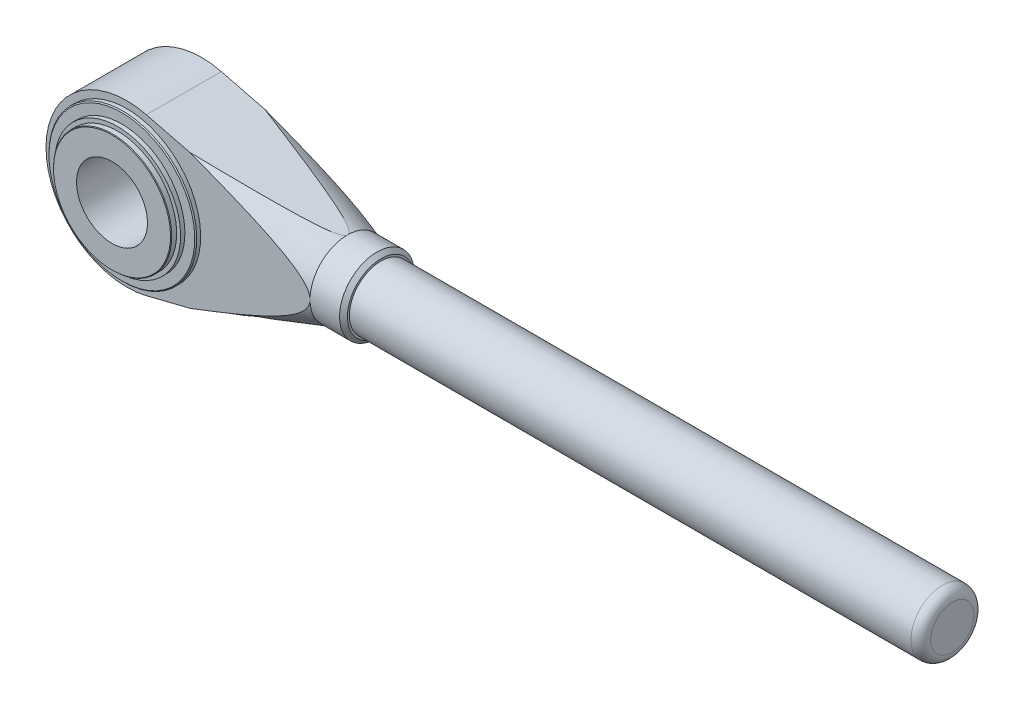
ISO-10303-21;
HEADER;
FILE_DESCRIPTION(('STEP AP214'),'2;1');
FILE_NAME('part.step','',(''),(''),'','','');
FILE_SCHEMA(('AUTOMOTIVE_DESIGN { 1 0 10303 214 1 1 1 1 }'));
ENDSEC;
DATA;
#1=APPLICATION_CONTEXT('core data for automotive mechanical design processes');
#2=APPLICATION_PROTOCOL_DEFINITION('international standard','automotive_design',2000,#1);
#3=PRODUCT_CONTEXT('',#1,'mechanical');
#4=PRODUCT('Part','Part','',(#3));
#5=PRODUCT_RELATED_PRODUCT_CATEGORY('part','',(#4));
#6=PRODUCT_DEFINITION_FORMATION('','',#4);
#7=PRODUCT_DEFINITION_CONTEXT('part definition',#1,'design');
#8=PRODUCT_DEFINITION('design','',#6,#7);
#9=PRODUCT_DEFINITION_SHAPE('','',#8);
#10=(LENGTH_UNIT() NAMED_UNIT(*) SI_UNIT(.MILLI.,.METRE.));
#11=(NAMED_UNIT(*) PLANE_ANGLE_UNIT() SI_UNIT($,.RADIAN.));
#12=(NAMED_UNIT(*) SI_UNIT($,.STERADIAN.) SOLID_ANGLE_UNIT());
#13=UNCERTAINTY_MEASURE_WITH_UNIT(LENGTH_MEASURE(1.E-05),#10,'distance_accuracy_value','');
#14=(GEOMETRIC_REPRESENTATION_CONTEXT(3) GLOBAL_UNCERTAINTY_ASSIGNED_CONTEXT((#13)) GLOBAL_UNIT_ASSIGNED_CONTEXT((#10,
#11,#12)) REPRESENTATION_CONTEXT('',''));
#15=CARTESIAN_POINT('',(0.,0.,0.));
#16=DIRECTION('',(0.,0.,1.));
#17=DIRECTION('',(1.,0.,0.));
#18=AXIS2_PLACEMENT_3D('',#15,#16,#17);
#19=CARTESIAN_POINT('',(93.,19.000000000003,45.5));
#20=DIRECTION('',(-0.242665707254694,-0.970109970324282,0.));
#21=DIRECTION('',(0.970109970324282,-0.242665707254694,0.));
#22=AXIS2_PLACEMENT_3D('',#19,#20,#21);
#23=PLANE('',#22);
#24=DIRECTION('',(-0.970109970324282,0.242665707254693,0.));
#25=VECTOR('',#24,1.);
#26=CARTESIAN_POINT('',(93.,19.000000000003,45.5));
#27=LINE('',#26,#25);
#28=CARTESIAN_POINT('',(32.074227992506,34.2401232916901,45.5));
#29=VERTEX_POINT('',#28);
#30=CARTESIAN_POINT('',(9.949294,39.7745090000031,45.5));
#31=VERTEX_POINT('',#30);
#32=EDGE_CURVE('E101',#29,#31,#27,.T.);
#33=ORIENTED_EDGE('',*,*,#32,.F.);
#34=CARTESIAN_POINT('',(32.073362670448,34.24033974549,45.5002));
#35=CARTESIAN_POINT('',(33.2265491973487,33.9518788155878,45.2336621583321));
#36=CARTESIAN_POINT('',(34.3795960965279,33.6634528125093,44.9664820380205));
#37=CARTESIAN_POINT('',(36.6853671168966,33.086681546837,44.4306372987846));
#38=CARTESIAN_POINT('',(37.8380912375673,32.798336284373,44.1619726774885));
#39=CARTESIAN_POINT('',(41.2966347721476,31.9332076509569,43.3532368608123));
#40=CARTESIAN_POINT('',(43.6018986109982,31.356563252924,42.8106375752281));
#41=CARTESIAN_POINT('',(48.232273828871,30.1983097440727,41.7112856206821));
#42=CARTESIAN_POINT('',(50.5573661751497,29.6167053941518,41.1544475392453));
#43=CARTESIAN_POINT('',(54.0423793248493,28.744955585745,40.3097099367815));
#44=CARTESIAN_POINT('',(55.203393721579,28.454536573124,40.0266050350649));
#45=CARTESIAN_POINT('',(57.5245206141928,27.8739241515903,39.4565341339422));
#46=CARTESIAN_POINT('',(58.6846331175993,27.5837307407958,39.1695681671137));
#47=CARTESIAN_POINT('',(61.0371363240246,26.9952697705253,38.5826091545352));
#48=CARTESIAN_POINT('',(62.2294948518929,26.697010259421,38.2824789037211));
#49=CARTESIAN_POINT('',(64.6127668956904,26.1008526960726,37.6760024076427));
#50=CARTESIAN_POINT('',(65.8036803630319,25.8029546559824,37.3696559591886));
#51=CARTESIAN_POINT('',(68.1849643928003,25.2072943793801,36.7486866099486));
#52=CARTESIAN_POINT('',(69.3753326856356,24.9095327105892,36.4340544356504));
#53=CARTESIAN_POINT('',(71.7533025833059,24.3147014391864,35.7944094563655));
#54=CARTESIAN_POINT('',(72.9409044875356,24.0176317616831,35.4693978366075));
#55=CARTESIAN_POINT('',(75.3058017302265,23.4260705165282,34.8071050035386));
#56=CARTESIAN_POINT('',(76.4831176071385,23.1315738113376,34.4699023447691));
#57=CARTESIAN_POINT('',(78.2451769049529,22.690807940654,33.9489678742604));
#58=CARTESIAN_POINT('',(78.8320121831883,22.5440155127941,33.7727590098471));
#59=CARTESIAN_POINT('',(80.0038831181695,22.2508808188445,33.4141321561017));
#60=CARTESIAN_POINT('',(80.5889188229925,22.1045385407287,33.2317143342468));
#61=CARTESIAN_POINT('',(81.7555136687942,21.8127236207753,32.8594718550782));
#62=CARTESIAN_POINT('',(82.3370773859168,21.6672498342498,32.669662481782));
#63=CARTESIAN_POINT('',(83.4970522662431,21.377090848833,32.2800816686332));
#64=CARTESIAN_POINT('',(84.0754635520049,21.2324056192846,32.0803106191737));
#65=CARTESIAN_POINT('',(85.2274038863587,20.9442564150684,31.6675910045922));
#66=CARTESIAN_POINT('',(85.800936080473,20.8007916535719,31.4546517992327));
#67=CARTESIAN_POINT('',(86.9411794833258,20.51556834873,31.0102649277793));
#68=CARTESIAN_POINT('',(87.5078925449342,20.3738093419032,30.7788224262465));
#69=CARTESIAN_POINT('',(88.2133358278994,20.1973480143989,30.4700471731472));
#70=CARTESIAN_POINT('',(88.3574834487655,20.1612905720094,30.4058503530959));
#71=CARTESIAN_POINT('',(88.644866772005,20.0894037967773,30.2752941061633));
#72=CARTESIAN_POINT('',(88.7881024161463,20.0535744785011,30.2089345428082));
#73=CARTESIAN_POINT('',(89.0735500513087,19.982171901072,30.0737365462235));
#74=CARTESIAN_POINT('',(89.21576155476,19.9465987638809,30.0048970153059));
#75=CARTESIAN_POINT('',(89.4988606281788,19.8757836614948,29.8643868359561));
#76=CARTESIAN_POINT('',(89.63974818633,19.8405416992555,29.7927161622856));
#77=CARTESIAN_POINT('',(90.0592203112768,19.735613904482,29.5732166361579));
#78=CARTESIAN_POINT('',(90.3354470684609,19.6665178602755,29.420512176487));
#79=CARTESIAN_POINT('',(90.8775296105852,19.530919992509,29.0971307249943));
#80=CARTESIAN_POINT('',(91.1433984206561,19.4644149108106,28.9264773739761));
#81=CARTESIAN_POINT('',(91.6030282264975,19.3494419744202,28.5967190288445));
#82=CARTESIAN_POINT('',(91.800159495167,19.3001310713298,28.4427866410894));
#83=CARTESIAN_POINT('',(92.0799516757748,19.23014316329,28.1936391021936));
#84=CARTESIAN_POINT('',(92.1703796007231,19.2075232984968,28.1077615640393));
#85=CARTESIAN_POINT('',(92.3438766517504,19.1641243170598,27.9285091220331));
#86=CARTESIAN_POINT('',(92.4269544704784,19.1433430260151,27.8351433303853));
#87=CARTESIAN_POINT('',(92.5706003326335,19.1074110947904,27.6543556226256));
#88=CARTESIAN_POINT('',(92.6326667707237,19.0918856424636,27.5682163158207));
#89=CARTESIAN_POINT('',(92.7462005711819,19.0634860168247,27.3885405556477));
#90=CARTESIAN_POINT('',(92.7976586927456,19.0506141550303,27.2949977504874));
#91=CARTESIAN_POINT('',(92.8863430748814,19.0284304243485,27.0990652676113));
#92=CARTESIAN_POINT('',(92.9233471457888,19.0191741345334,26.996565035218));
#93=CARTESIAN_POINT('',(92.9768803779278,19.0057831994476,26.7861203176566));
#94=CARTESIAN_POINT('',(92.99347538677,19.0016320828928,26.6781945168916));
#95=CARTESIAN_POINT('',(93.0027215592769,18.9993192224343,26.4751664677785));
#96=CARTESIAN_POINT('',(92.9981732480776,19.0004569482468,26.3801967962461));
#97=CARTESIAN_POINT('',(92.9721036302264,19.0069780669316,26.1927198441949));
#98=CARTESIAN_POINT('',(92.9505573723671,19.0123677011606,26.100216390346));
#99=CARTESIAN_POINT('',(92.8865398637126,19.0283811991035,25.8992128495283));
#100=CARTESIAN_POINT('',(92.840368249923,19.0399306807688,25.7919939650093));
#101=CARTESIAN_POINT('',(92.7323962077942,19.0669390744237,25.5863535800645));
#102=CARTESIAN_POINT('',(92.6705621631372,19.0824063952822,25.4879516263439));
#103=CARTESIAN_POINT('',(92.4791643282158,19.1302831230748,25.219229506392));
#104=CARTESIAN_POINT('',(92.3366962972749,19.1659204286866,25.0588511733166));
#105=CARTESIAN_POINT('',(92.0328141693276,19.2419342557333,24.7586739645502));
#106=CARTESIAN_POINT('',(91.8713340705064,19.2823272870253,24.61895081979));
#107=CARTESIAN_POINT('',(91.5521143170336,19.3621777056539,24.3661649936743));
#108=CARTESIAN_POINT('',(91.3953060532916,19.4014021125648,24.2518373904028));
#109=CARTESIAN_POINT('',(91.0755534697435,19.4813858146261,24.0326225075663));
#110=CARTESIAN_POINT('',(90.912605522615,19.522146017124,23.9277409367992));
#111=CARTESIAN_POINT('',(90.4167895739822,19.646170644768,23.6236025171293));
#112=CARTESIAN_POINT('',(90.0776089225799,19.7310141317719,23.4353395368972));
#113=CARTESIAN_POINT('',(89.3882600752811,19.9034495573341,23.0769005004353));
#114=CARTESIAN_POINT('',(89.0380408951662,19.9910542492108,22.9068318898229));
#115=CARTESIAN_POINT('',(88.3321979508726,20.1676155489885,22.5805967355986));
#116=CARTESIAN_POINT('',(87.9765826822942,20.2565700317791,22.4244105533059));
#117=CARTESIAN_POINT('',(87.2662963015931,20.4342428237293,22.1242560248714));
#118=CARTESIAN_POINT('',(86.9116798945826,20.5229474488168,21.9801488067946));
#119=CARTESIAN_POINT('',(86.1995947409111,20.7010701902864,21.6996020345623));
#120=CARTESIAN_POINT('',(85.8421258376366,20.7904883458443,21.56316290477));
#121=CARTESIAN_POINT('',(84.7663585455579,21.0595834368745,21.1628805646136));
#122=CARTESIAN_POINT('',(84.0448769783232,21.2400566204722,20.9081452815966));
#123=CARTESIAN_POINT('',(82.595679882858,21.6025623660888,20.4147940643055));
#124=CARTESIAN_POINT('',(81.8679569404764,21.7845967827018,20.1762016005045));
#125=CARTESIAN_POINT('',(80.409014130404,22.1495403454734,19.7110960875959));
#126=CARTESIAN_POINT('',(79.6777947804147,22.3324493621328,19.4845813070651));
#127=CARTESIAN_POINT('',(78.2154564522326,22.6982422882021,19.0414789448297));
#128=CARTESIAN_POINT('',(77.4843469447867,22.881123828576,18.8248579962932));
#129=CARTESIAN_POINT('',(76.0201618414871,23.2473787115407,18.3987131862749));
#130=CARTESIAN_POINT('',(75.2870861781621,23.4307520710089,18.189189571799));
#131=CARTESIAN_POINT('',(73.0867174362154,23.9811577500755,17.5693984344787));
#132=CARTESIAN_POINT('',(71.6171859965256,24.3487499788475,17.1675835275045));
#133=CARTESIAN_POINT('',(68.568155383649,25.1114420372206,16.3507928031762));
#134=CARTESIAN_POINT('',(66.9883705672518,25.5066133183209,15.9369585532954));
#135=CARTESIAN_POINT('',(63.8257701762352,26.2977140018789,15.1217138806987));
#136=CARTESIAN_POINT('',(62.2429545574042,26.6936434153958,14.7203036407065));
#137=CARTESIAN_POINT('',(59.0746094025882,27.4861811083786,13.9265133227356));
#138=CARTESIAN_POINT('',(57.4890791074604,27.8827895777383,13.5341364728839));
#139=CARTESIAN_POINT('',(54.3164020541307,28.676410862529,12.7563861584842));
#140=CARTESIAN_POINT('',(52.7292552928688,29.0734236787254,12.3710127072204));
#141=CARTESIAN_POINT('',(49.5539963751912,29.8676907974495,11.6058178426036));
#142=CARTESIAN_POINT('',(47.965884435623,30.2649450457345,11.2259954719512));
#143=CARTESIAN_POINT('',(44.788675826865,31.0596998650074,10.4707390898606));
#144=CARTESIAN_POINT('',(43.1995791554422,31.457200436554,10.0953050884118));
#145=CARTESIAN_POINT('',(40.0213274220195,32.2522161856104,9.34817488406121));
#146=CARTESIAN_POINT('',(38.4321727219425,32.649731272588,8.97647704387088));
#147=CARTESIAN_POINT('',(35.2532188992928,33.4449226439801,8.23605574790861));
#148=CARTESIAN_POINT('',(33.6634197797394,33.8425989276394,7.86733227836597));
#149=CARTESIAN_POINT('',(32.073362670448,34.24033974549,7.49979999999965));
#150=B_SPLINE_CURVE_WITH_KNOTS('',3,(#34,#35,#36,#37,#38,#39,#40,#41,#42,#43,#44,#45,#46,#47,
#48,#49,#50,#51,#52,#53,#54,#55,#56,#57,#58,#59,#60,#61,#62,#63,#64,#65,#66,#67,#68,#69,#70,#71,
#72,#73,#74,#75,#76,#77,#78,#79,#80,#81,#82,#83,#84,#85,#86,#87,#88,#89,#90,#91,#92,#93,#94,#95,
#96,#97,#98,#99,#100,#101,#102,#103,#104,#105,#106,#107,#108,#109,#110,#111,#112,#113,#114,#115,
#116,#117,#118,#119,#120,#121,#122,#123,#124,#125,#126,#127,#128,#129,#130,#131,#132,#133,#134,
#135,#136,#137,#138,#139,#140,#141,#142,#143,#144,#145,#146,#147,#148,#149),.UNSPECIFIED.,.F.,
.F.,(4,2,2,2,2,2,2,2,2,2,2,2,2,2,2,2,2,2,2,2,2,2,2,2,2,2,2,2,2,2,2,2,2,2,2,2,2,2,2,2,2,2,2,2,2,
2,2,2,2,2,2,2,2,2,2,2,2,4),(0.,3.6546984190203,7.30940267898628,14.6217480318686,
22.0034182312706,25.6928595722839,29.3822698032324,33.1778862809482,36.9736270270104,
40.7738135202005,44.5735676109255,48.3521261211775,50.2422755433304,52.1323740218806,
54.0187525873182,55.9050572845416,57.7900362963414,59.6744910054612,60.1600689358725,
60.6456775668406,61.1315038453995,61.6173344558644,62.5861716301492,63.553748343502,
64.3169800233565,64.6968935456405,65.076351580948,65.3976449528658,65.7192170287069,
66.0455542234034,66.3708357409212,66.6543555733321,66.9382923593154,67.2882447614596,
67.6389547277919,68.2876832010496,68.9387341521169,69.5322282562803,70.1260786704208,
71.3162792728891,72.5131600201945,73.7083197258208,74.8869847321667,76.0657149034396,
78.4237654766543,80.7851739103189,83.1462429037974,85.4986510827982,87.8511410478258,
92.5525910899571,97.5931910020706,102.633865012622,107.676313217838,112.718770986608,
117.760348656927,122.801937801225,127.841211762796,132.880462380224),.UNSPECIFIED.);
#151=CARTESIAN_POINT('',(93.,19.000000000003,26.5));
#152=VERTEX_POINT('',#151);
#153=EDGE_CURVE('E79',#29,#152,#150,.T.);
#154=ORIENTED_EDGE('',*,*,#153,.T.);
#155=CARTESIAN_POINT('',(32.074227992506,34.2401232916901,7.5));
#156=VERTEX_POINT('',#155);
#157=EDGE_CURVE('E91',#152,#156,#150,.T.);
#158=ORIENTED_EDGE('',*,*,#157,.T.);
#159=DIRECTION('',(-0.970109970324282,0.242665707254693,0.));
#160=VECTOR('',#159,1.);
#161=CARTESIAN_POINT('',(93.,19.000000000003,7.5));
#162=LINE('',#161,#160);
#163=CARTESIAN_POINT('',(9.949294,39.7745090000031,7.5));
#164=VERTEX_POINT('',#163);
#165=EDGE_CURVE('E154',#156,#164,#162,.T.);
#166=ORIENTED_EDGE('',*,*,#165,.T.);
#167=DIRECTION('',(0.,0.,-1.));
#168=VECTOR('',#167,1.);
#169=CARTESIAN_POINT('',(9.949294,39.7745090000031,45.5));
#170=LINE('',#169,#168);
#171=EDGE_CURVE('E114',#31,#164,#170,.T.);
#172=ORIENTED_EDGE('',*,*,#171,.F.);
#173=EDGE_LOOP('',(#33,#154,#158,#166,#172));
#174=FACE_BOUND('',#173,.T.);
#175=ADVANCED_FACE('F15',(#174),#23,.F.);
#176=CARTESIAN_POINT('',(0.,3.05311331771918E-12,45.5));
#177=DIRECTION('',(0.,0.,-1.));
#178=DIRECTION('',(-1.,0.,0.));
#179=AXIS2_PLACEMENT_3D('',#176,#177,#178);
#180=CYLINDRICAL_SURFACE('',#179,41.0000002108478);
#181=DIRECTION('',(0.,0.,-1.));
#182=VECTOR('',#181,1.);
#183=CARTESIAN_POINT('',(9.949294,-39.7745089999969,45.5));
#184=LINE('',#183,#182);
#185=CARTESIAN_POINT('',(9.949294,-39.7745089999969,45.5));
#186=VERTEX_POINT('',#185);
#187=CARTESIAN_POINT('',(9.949294,-39.7745089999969,7.5));
#188=VERTEX_POINT('',#187);
#189=EDGE_CURVE('E146',#186,#188,#184,.T.);
#190=ORIENTED_EDGE('',*,*,#189,.F.);
#191=CARTESIAN_POINT('',(0.,3.05311331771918E-12,45.5));
#192=DIRECTION('',(0.,0.,1.));
#193=DIRECTION('',(1.,0.,0.));
#194=AXIS2_PLACEMENT_3D('',#191,#192,#193);
#195=CIRCLE('',#194,41.0000002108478);
#196=EDGE_CURVE('E166',#31,#186,#195,.T.);
#197=ORIENTED_EDGE('',*,*,#196,.F.);
#198=ORIENTED_EDGE('',*,*,#171,.T.);
#199=CARTESIAN_POINT('',(0.,3.05311331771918E-12,7.5));
#200=DIRECTION('',(0.,0.,1.));
#201=DIRECTION('',(1.,0.,0.));
#202=AXIS2_PLACEMENT_3D('',#199,#200,#201);
#203=CIRCLE('',#202,41.0000002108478);
#204=EDGE_CURVE('E149',#164,#188,#203,.T.);
#205=ORIENTED_EDGE('',*,*,#204,.T.);
#206=EDGE_LOOP('',(#190,#197,#198,#205));
#207=FACE_BOUND('',#206,.T.);
#208=ADVANCED_FACE('F179',(#207),#180,.T.);
#209=CARTESIAN_POINT('',(93.,-18.9999999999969,45.5));
#210=DIRECTION('',(0.242665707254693,-0.970109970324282,0.));
#211=DIRECTION('',(0.970109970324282,0.242665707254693,0.));
#212=AXIS2_PLACEMENT_3D('',#209,#210,#211);
#213=PLANE('',#212);
#214=CARTESIAN_POINT('',(32.073362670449,-34.2403397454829,45.5002));
#215=CARTESIAN_POINT('',(33.2265491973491,-33.9518788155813,45.2336621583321));
#216=CARTESIAN_POINT('',(34.3795960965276,-33.6634528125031,44.9664820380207));
#217=CARTESIAN_POINT('',(36.685367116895,-33.0866815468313,44.4306372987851));
#218=CARTESIAN_POINT('',(37.838091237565,-32.7983362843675,44.1619726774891));
#219=CARTESIAN_POINT('',(41.2966347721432,-31.9332076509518,43.3532368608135));
#220=CARTESIAN_POINT('',(43.6018986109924,-31.3565632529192,42.8106375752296));
#221=CARTESIAN_POINT('',(48.2322738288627,-30.1983097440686,41.7112856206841));
#222=CARTESIAN_POINT('',(50.5573661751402,-29.616705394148,41.1544475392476));
#223=CARTESIAN_POINT('',(54.0423793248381,-28.7449555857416,40.3097099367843));
#224=CARTESIAN_POINT('',(55.2033937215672,-28.4545365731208,40.0266050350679));
#225=CARTESIAN_POINT('',(57.5245206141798,-27.8739241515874,39.4565341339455));
#226=CARTESIAN_POINT('',(58.6846331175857,-27.5837307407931,39.1695681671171));
#227=CARTESIAN_POINT('',(61.0371363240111,-26.9952697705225,38.5826091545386));
#228=CARTESIAN_POINT('',(62.22949485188,-26.6970102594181,38.2824789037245));
#229=CARTESIAN_POINT('',(64.6127668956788,-26.1008526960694,37.6760024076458));
#230=CARTESIAN_POINT('',(65.8036803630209,-25.802954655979,37.3696559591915));
#231=CARTESIAN_POINT('',(68.1849643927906,-25.2072943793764,36.7486866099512));
#232=CARTESIAN_POINT('',(69.3753326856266,-24.9095327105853,36.4340544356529));
#233=CARTESIAN_POINT('',(71.7533025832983,-24.3147014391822,35.7944094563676));
#234=CARTESIAN_POINT('',(72.9409044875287,-24.0176317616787,35.4693978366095));
#235=CARTESIAN_POINT('',(75.3058017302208,-23.4260705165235,34.8071050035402));
#236=CARTESIAN_POINT('',(76.4831176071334,-23.1315738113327,34.4699023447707));
#237=CARTESIAN_POINT('',(78.2451769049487,-22.6908079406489,33.9489678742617));
#238=CARTESIAN_POINT('',(78.8320121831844,-22.5440155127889,33.7727590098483));
#239=CARTESIAN_POINT('',(80.0038831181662,-22.2508808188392,33.4141321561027));
#240=CARTESIAN_POINT('',(80.5889188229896,-22.1045385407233,33.2317143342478));
#241=CARTESIAN_POINT('',(81.7555136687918,-21.8127236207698,32.859471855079));
#242=CARTESIAN_POINT('',(82.3370773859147,-21.6672498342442,32.6696624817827));
#243=CARTESIAN_POINT('',(83.4970522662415,-21.3770908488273,32.2800816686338));
#244=CARTESIAN_POINT('',(84.0754635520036,-21.2324056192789,32.0803106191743));
#245=CARTESIAN_POINT('',(85.2274038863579,-20.9442564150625,31.6675910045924));
#246=CARTESIAN_POINT('',(85.8009360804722,-20.8007916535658,31.4546517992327));
#247=CARTESIAN_POINT('',(86.9411794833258,-20.515568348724,31.0102649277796));
#248=CARTESIAN_POINT('',(87.5078925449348,-20.3738093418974,30.7788224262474));
#249=CARTESIAN_POINT('',(88.2133358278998,-20.1973480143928,30.4700471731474));
#250=CARTESIAN_POINT('',(88.3574834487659,-20.1612905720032,30.4058503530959));
#251=CARTESIAN_POINT('',(88.6448667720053,-20.0894037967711,30.275294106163));
#252=CARTESIAN_POINT('',(88.7881024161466,-20.0535744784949,30.208934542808));
#253=CARTESIAN_POINT('',(89.0735500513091,-19.9821719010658,30.0737365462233));
#254=CARTESIAN_POINT('',(89.2157615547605,-19.9465987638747,30.0048970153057));
#255=CARTESIAN_POINT('',(89.4988606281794,-19.8757836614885,29.8643868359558));
#256=CARTESIAN_POINT('',(89.6397481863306,-19.8405416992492,29.7927161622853));
#257=CARTESIAN_POINT('',(90.0592203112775,-19.7356139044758,29.5732166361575));
#258=CARTESIAN_POINT('',(90.3354470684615,-19.6665178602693,29.4205121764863));
#259=CARTESIAN_POINT('',(90.877529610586,-19.5309199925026,29.0971307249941));
#260=CARTESIAN_POINT('',(91.1433984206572,-19.464414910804,28.9264773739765));
#261=CARTESIAN_POINT('',(91.6030282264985,-19.3494419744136,28.5967190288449));
#262=CARTESIAN_POINT('',(91.8001594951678,-19.3001310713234,28.4427866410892));
#263=CARTESIAN_POINT('',(92.0799516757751,-19.2301431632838,28.1936391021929));
#264=CARTESIAN_POINT('',(92.1703796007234,-19.2075232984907,28.1077615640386));
#265=CARTESIAN_POINT('',(92.3438766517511,-19.1641243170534,27.9285091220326));
#266=CARTESIAN_POINT('',(92.4269544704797,-19.1433430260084,27.8351433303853));
#267=CARTESIAN_POINT('',(92.5706003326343,-19.1074110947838,27.6543556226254));
#268=CARTESIAN_POINT('',(92.6326667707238,-19.0918856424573,27.56821631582));
#269=CARTESIAN_POINT('',(92.7462005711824,-19.0634860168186,27.388540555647));
#270=CARTESIAN_POINT('',(92.7976586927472,-19.0506141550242,27.2949977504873));
#271=CARTESIAN_POINT('',(92.8863430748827,-19.0284304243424,27.0990652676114));
#272=CARTESIAN_POINT('',(92.9233471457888,-19.0191741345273,26.9965650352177));
#273=CARTESIAN_POINT('',(92.9768803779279,-19.0057831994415,26.7861203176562));
#274=CARTESIAN_POINT('',(92.9934753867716,-19.0016320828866,26.6781945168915));
#275=CARTESIAN_POINT('',(93.0027215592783,-18.9993192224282,26.4751664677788));
#276=CARTESIAN_POINT('',(92.9981732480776,-19.0004569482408,26.3801967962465));
#277=CARTESIAN_POINT('',(92.9721036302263,-19.0069780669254,26.1927198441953));
#278=CARTESIAN_POINT('',(92.9505573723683,-19.0123677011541,26.1002163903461));
#279=CARTESIAN_POINT('',(92.8865398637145,-19.0283811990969,25.8992128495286));
#280=CARTESIAN_POINT('',(92.8403682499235,-19.0399306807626,25.7919939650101));
#281=CARTESIAN_POINT('',(92.7323962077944,-19.0669390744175,25.5863535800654));
#282=CARTESIAN_POINT('',(92.6705621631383,-19.0824063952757,25.4879516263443));
#283=CARTESIAN_POINT('',(92.4791643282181,-19.130283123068,25.219229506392));
#284=CARTESIAN_POINT('',(92.3366962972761,-19.1659204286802,25.0588511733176));
#285=CARTESIAN_POINT('',(92.0328141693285,-19.241934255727,24.7586739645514));
#286=CARTESIAN_POINT('',(91.8713340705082,-19.2823272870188,24.6189508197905));
#287=CARTESIAN_POINT('',(91.5521143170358,-19.3621777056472,24.3661649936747));
#288=CARTESIAN_POINT('',(91.3953060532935,-19.4014021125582,24.2518373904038));
#289=CARTESIAN_POINT('',(91.0755534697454,-19.4813858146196,24.0326225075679));
#290=CARTESIAN_POINT('',(90.9126055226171,-19.5221460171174,23.9277409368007));
#291=CARTESIAN_POINT('',(90.4167895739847,-19.6461706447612,23.6236025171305));
#292=CARTESIAN_POINT('',(90.0776089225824,-19.7310141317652,23.4353395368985));
#293=CARTESIAN_POINT('',(89.3882600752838,-19.9034495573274,23.0769005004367));
#294=CARTESIAN_POINT('',(89.0380408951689,-19.991054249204,22.9068318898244));
#295=CARTESIAN_POINT('',(88.3321979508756,-20.1676155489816,22.5805967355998));
#296=CARTESIAN_POINT('',(87.9765826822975,-20.2565700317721,22.4244105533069));
#297=CARTESIAN_POINT('',(87.2662963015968,-20.4342428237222,22.1242560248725));
#298=CARTESIAN_POINT('',(86.9116798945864,-20.5229474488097,21.980148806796));
#299=CARTESIAN_POINT('',(86.1995947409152,-20.7010701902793,21.699602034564));
#300=CARTESIAN_POINT('',(85.8421258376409,-20.7904883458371,21.5631629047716));
#301=CARTESIAN_POINT('',(84.7663585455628,-21.0595834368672,21.1628805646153));
#302=CARTESIAN_POINT('',(84.0448769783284,-21.2400566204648,20.9081452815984));
#303=CARTESIAN_POINT('',(82.5956798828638,-21.6025623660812,20.4147940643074));
#304=CARTESIAN_POINT('',(81.8679569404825,-21.7845967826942,20.1762016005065));
#305=CARTESIAN_POINT('',(80.4090141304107,-22.1495403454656,19.7110960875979));
#306=CARTESIAN_POINT('',(79.6777947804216,-22.3324493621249,19.4845813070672));
#307=CARTESIAN_POINT('',(78.2154564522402,-22.6982422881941,19.041478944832));
#308=CARTESIAN_POINT('',(77.4843469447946,-22.8811238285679,18.8248579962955));
#309=CARTESIAN_POINT('',(76.0201618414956,-23.2473787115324,18.3987131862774));
#310=CARTESIAN_POINT('',(75.287086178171,-23.4307520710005,18.1891895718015));
#311=CARTESIAN_POINT('',(73.0867174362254,-23.9811577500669,17.5693984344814));
#312=CARTESIAN_POINT('',(71.6171859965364,-24.3487499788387,17.1675835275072));
#313=CARTESIAN_POINT('',(68.5681553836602,-25.1114420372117,16.3507928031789));
#314=CARTESIAN_POINT('',(66.9883705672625,-25.5066133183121,15.9369585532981));
#315=CARTESIAN_POINT('',(63.8257701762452,-26.2977140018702,15.1217138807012));
#316=CARTESIAN_POINT('',(62.2429545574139,-26.6936434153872,14.7203036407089));
#317=CARTESIAN_POINT('',(59.0746094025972,-27.4861811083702,13.9265133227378));
#318=CARTESIAN_POINT('',(57.4890791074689,-27.8827895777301,13.5341364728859));
#319=CARTESIAN_POINT('',(54.3164020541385,-28.6764108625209,12.756386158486));
#320=CARTESIAN_POINT('',(52.7292552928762,-29.0734236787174,12.3710127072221));
#321=CARTESIAN_POINT('',(49.5539963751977,-29.8676907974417,11.6058178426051));
#322=CARTESIAN_POINT('',(47.965884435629,-30.2649450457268,11.2259954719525));
#323=CARTESIAN_POINT('',(44.78867582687,-31.059699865,10.4707390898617));
#324=CARTESIAN_POINT('',(43.1995791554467,-31.4572004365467,10.0953050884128));
#325=CARTESIAN_POINT('',(40.021327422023,-32.2522161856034,9.34817488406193));
#326=CARTESIAN_POINT('',(38.4321727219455,-32.6497312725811,8.97647704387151));
#327=CARTESIAN_POINT('',(35.2532188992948,-33.4449226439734,8.23605574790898));
#328=CARTESIAN_POINT('',(33.663419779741,-33.8425989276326,7.86733227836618));
#329=CARTESIAN_POINT('',(32.073362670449,-34.2403397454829,7.4997999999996));
#330=B_SPLINE_CURVE_WITH_KNOTS('',3,(#214,#215,#216,#217,#218,#219,#220,#221,#222,#223,#224,
#225,#226,#227,#228,#229,#230,#231,#232,#233,#234,#235,#236,#237,#238,#239,#240,#241,#242,#243,
#244,#245,#246,#247,#248,#249,#250,#251,#252,#253,#254,#255,#256,#257,#258,#259,#260,#261,#262,
#263,#264,#265,#266,#267,#268,#269,#270,#271,#272,#273,#274,#275,#276,#277,#278,#279,#280,#281,
#282,#283,#284,#285,#286,#287,#288,#289,#290,#291,#292,#293,#294,#295,#296,#297,#298,#299,#300,
#301,#302,#303,#304,#305,#306,#307,#308,#309,#310,#311,#312,#313,#314,#315,#316,#317,#318,#319,
#320,#321,#322,#323,#324,#325,#326,#327,#328,#329),.UNSPECIFIED.,.F.,.F.,(4,2,2,2,2,2,2,2,2,2,2,
2,2,2,2,2,2,2,2,2,2,2,2,2,2,2,2,2,2,2,2,2,2,2,2,2,2,2,2,2,2,2,2,2,2,2,2,2,2,2,2,2,2,2,2,2,2,4),
(0.,3.6546984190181,7.30940267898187,14.6217480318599,22.0034182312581,25.6928595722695,
29.3822698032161,33.1778862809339,36.9736270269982,40.7738135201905,44.5735676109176,
48.3521261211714,50.2422755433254,52.1323740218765,54.018752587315,55.9050572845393,
57.7900362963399,59.6744910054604,60.1600689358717,60.6456775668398,61.1315038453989,
61.6173344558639,62.5861716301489,63.5537483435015,64.3169800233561,64.6968935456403,
65.0763515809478,65.3976449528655,65.7192170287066,66.0455542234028,66.3708357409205,
66.6543555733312,66.9382923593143,67.2882447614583,67.6389547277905,68.2876832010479,
68.9387341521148,69.5322282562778,70.126078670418,71.316279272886,72.5131600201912,
73.7083197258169,74.8869847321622,76.0657149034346,78.4237654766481,80.785173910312,
83.1462429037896,85.4986510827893,87.8511410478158,92.5525910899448,97.5931910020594,
102.633865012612,107.67631321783,112.7187709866,117.760348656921,122.801937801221,
127.841211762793,132.880462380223),.UNSPECIFIED.);
#331=CARTESIAN_POINT('',(32.0742279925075,-34.2401232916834,45.5));
#332=VERTEX_POINT('',#331);
#333=CARTESIAN_POINT('',(93.,-18.9999999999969,26.5));
#334=VERTEX_POINT('',#333);
#335=EDGE_CURVE('E97',#332,#334,#330,.T.);
#336=ORIENTED_EDGE('',*,*,#335,.F.);
#337=DIRECTION('',(-0.970109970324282,-0.242665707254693,0.));
#338=VECTOR('',#337,1.);
#339=CARTESIAN_POINT('',(93.,-18.9999999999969,45.5));
#340=LINE('',#339,#338);
#341=EDGE_CURVE('E163',#332,#186,#340,.T.);
#342=ORIENTED_EDGE('',*,*,#341,.T.);
#343=ORIENTED_EDGE('',*,*,#189,.T.);
#344=DIRECTION('',(-0.970109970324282,-0.242665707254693,0.));
#345=VECTOR('',#344,1.);
#346=CARTESIAN_POINT('',(93.,-18.9999999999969,7.5));
#347=LINE('',#346,#345);
#348=CARTESIAN_POINT('',(32.0742279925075,-34.2401232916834,7.5));
#349=VERTEX_POINT('',#348);
#350=EDGE_CURVE('E141',#349,#188,#347,.T.);
#351=ORIENTED_EDGE('',*,*,#350,.F.);
#352=EDGE_CURVE('E45',#334,#349,#330,.T.);
#353=ORIENTED_EDGE('',*,*,#352,.F.);
#354=EDGE_LOOP('',(#336,#342,#343,#351,#353));
#355=FACE_BOUND('',#354,.T.);
#356=ADVANCED_FACE('F144',(#355),#213,.T.);
#357=CARTESIAN_POINT('',(0.,3.05311331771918E-12,45.5));
#358=DIRECTION('',(0.,0.,1.));
#359=DIRECTION('',(1.,0.,0.));
#360=AXIS2_PLACEMENT_3D('',#357,#358,#359);
#361=PLANE('',#360);
#362=CARTESIAN_POINT('',(-25.003689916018,-54.8460012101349,45.5));
#363=CARTESIAN_POINT('',(-22.669895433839,-54.0287766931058,45.5));
#364=CARTESIAN_POINT('',(-20.3366976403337,-53.2098447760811,45.5));
#365=CARTESIAN_POINT('',(-15.6717005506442,-51.5679772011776,45.5));
#366=CARTESIAN_POINT('',(-13.3399012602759,-50.7450415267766,45.5));
#367=CARTESIAN_POINT('',(-8.67493215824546,-49.0935244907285,45.5));
#368=CARTESIAN_POINT('',(-6.34176443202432,-48.2649372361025,45.5));
#369=CARTESIAN_POINT('',(-1.67734115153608,-46.6024167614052,45.5));
#370=CARTESIAN_POINT('',(0.653914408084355,-45.7684835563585,45.5));
#371=CARTESIAN_POINT('',(5.35857887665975,-44.0784004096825,45.5));
#372=CARTESIAN_POINT('',(7.73194450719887,-43.2221299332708,45.5));
#373=CARTESIAN_POINT('',(12.4758734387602,-41.5018625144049,45.5));
#374=CARTESIAN_POINT('',(14.8464367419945,-40.6378655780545,45.5));
#375=CARTESIAN_POINT('',(19.5812508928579,-38.9016545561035,45.5));
#376=CARTESIAN_POINT('',(21.9455059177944,-38.0294518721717,45.5));
#377=CARTESIAN_POINT('',(26.6697622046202,-36.2737867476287,45.5));
#378=CARTESIAN_POINT('',(29.0297635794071,-35.390324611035,45.5));
#379=CARTESIAN_POINT('',(33.7394706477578,-33.6113499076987,45.5));
#380=CARTESIAN_POINT('',(36.0891875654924,-32.7158671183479,45.5));
#381=CARTESIAN_POINT('',(39.6088064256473,-31.3594205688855,45.5));
#382=CARTESIAN_POINT('',(40.7812479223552,-30.9050438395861,45.5));
#383=CARTESIAN_POINT('',(43.1241814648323,-29.9912939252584,45.5));
#384=CARTESIAN_POINT('',(44.2946735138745,-29.5319207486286,45.5));
#385=CARTESIAN_POINT('',(46.6378206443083,-28.6057354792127,45.5));
#386=CARTESIAN_POINT('',(47.8104672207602,-28.1389018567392,45.5));
#387=CARTESIAN_POINT('',(50.1531104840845,-27.1986377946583,45.5));
#388=CARTESIAN_POINT('',(51.3231071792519,-26.7252073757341,45.5));
#389=CARTESIAN_POINT('',(53.6595721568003,-25.7708624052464,45.5));
#390=CARTESIAN_POINT('',(54.8260415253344,-25.2899505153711,45.5));
#391=CARTESIAN_POINT('',(57.1552475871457,-24.3191804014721,45.5));
#392=CARTESIAN_POINT('',(58.3179843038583,-23.8293222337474,45.5));
#393=CARTESIAN_POINT('',(60.6305492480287,-22.8425935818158,45.5));
#394=CARTESIAN_POINT('',(61.780410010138,-22.3457994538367,45.5));
#395=CARTESIAN_POINT('',(64.0746902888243,-21.3396942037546,45.5));
#396=CARTESIAN_POINT('',(65.2191096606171,-20.8303827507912,45.5));
#397=CARTESIAN_POINT('',(67.5026698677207,-19.7958298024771,45.5));
#398=CARTESIAN_POINT('',(68.6418010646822,-19.2705669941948,45.5));
#399=CARTESIAN_POINT('',(70.9111230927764,-18.2012151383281,45.5));
#400=CARTESIAN_POINT('',(72.0413146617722,-17.6571276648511,45.5));
#401=CARTESIAN_POINT('',(73.7238226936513,-16.8249675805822,45.5));
#402=CARTESIAN_POINT('',(74.2806030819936,-16.5459132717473,45.5));
#403=CARTESIAN_POINT('',(75.3907339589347,-15.9810706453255,45.5));
#404=CARTESIAN_POINT('',(75.9440844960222,-15.6952824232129,45.5));
#405=CARTESIAN_POINT('',(77.046955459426,-15.1158892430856,45.5));
#406=CARTESIAN_POINT('',(77.5964743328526,-14.8222813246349,45.5));
#407=CARTESIAN_POINT('',(78.6906603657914,-14.2261610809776,45.5));
#408=CARTESIAN_POINT('',(79.2353275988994,-13.9236488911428,45.5));
#409=CARTESIAN_POINT('',(80.3174518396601,-13.3089850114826,45.5));
#410=CARTESIAN_POINT('',(80.8549231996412,-12.9968586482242,45.5));
#411=CARTESIAN_POINT('',(81.9226619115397,-12.3603901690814,45.5));
#412=CARTESIAN_POINT('',(82.4529287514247,-12.0360471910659,45.5));
#413=CARTESIAN_POINT('',(83.5039318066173,-11.3730366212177,45.5));
#414=CARTESIAN_POINT('',(84.0246744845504,-11.0343793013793,45.5));
#415=CARTESIAN_POINT('',(85.0542698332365,-10.3395091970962,45.5));
#416=CARTESIAN_POINT('',(85.5631249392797,-9.98330005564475,45.5));
#417=CARTESIAN_POINT('',(86.1923361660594,-9.52226398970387,45.5));
#418=CARTESIAN_POINT('',(86.3201253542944,-9.42753835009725,45.5));
#419=CARTESIAN_POINT('',(86.57457099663,-9.236573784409,45.5));
#420=CARTESIAN_POINT('',(86.701227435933,-9.14033483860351,45.5));
#421=CARTESIAN_POINT('',(87.0793844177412,-8.84920000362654,45.5));
#422=CARTESIAN_POINT('',(87.3290475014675,-8.65190446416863,45.5));
#423=CARTESIAN_POINT('',(87.822877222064,-8.24985734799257,45.5));
#424=CARTESIAN_POINT('',(88.0670358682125,-8.04509593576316,45.5));
#425=CARTESIAN_POINT('',(88.5483122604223,-7.62745208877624,45.5));
#426=CARTESIAN_POINT('',(88.7854303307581,-7.41457002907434,45.5));
#427=CARTESIAN_POINT('',(89.2485556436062,-6.98199042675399,45.5));
#428=CARTESIAN_POINT('',(89.4746561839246,-6.76239316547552,45.5));
#429=CARTESIAN_POINT('',(89.9165259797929,-6.31305276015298,45.5));
#430=CARTESIAN_POINT('',(90.1322968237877,-6.08331118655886,45.5));
#431=CARTESIAN_POINT('',(90.5506055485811,-5.61280545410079,45.5));
#432=CARTESIAN_POINT('',(90.7531680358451,-5.37206330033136,45.5));
#433=CARTESIAN_POINT('',(91.1421038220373,-4.87792755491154,45.5));
#434=CARTESIAN_POINT('',(91.3284859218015,-4.6245409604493,45.5));
#435=CARTESIAN_POINT('',(91.6282107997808,-4.18152813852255,45.5));
#436=CARTESIAN_POINT('',(91.7467531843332,-3.99543660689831,45.5));
#437=CARTESIAN_POINT('',(91.9718782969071,-3.61621485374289,45.5));
#438=CARTESIAN_POINT('',(92.0784606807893,-3.42308442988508,45.5));
#439=CARTESIAN_POINT('',(92.3770550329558,-2.8327755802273,45.5));
#440=CARTESIAN_POINT('',(92.5481853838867,-2.42429292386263,45.5));
#441=CARTESIAN_POINT('',(92.7371957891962,-1.82827045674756,45.5));
#442=CARTESIAN_POINT('',(92.7863322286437,-1.65033464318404,45.5));
#443=CARTESIAN_POINT('',(92.8701071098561,-1.29111460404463,45.5));
#444=CARTESIAN_POINT('',(92.904753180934,-1.10983219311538,45.5));
#445=CARTESIAN_POINT('',(92.958494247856,-0.745117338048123,45.5));
#446=CARTESIAN_POINT('',(92.9776017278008,-0.56168674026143,45.5));
#447=CARTESIAN_POINT('',(92.9997000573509,-0.193844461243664,45.5));
#448=CARTESIAN_POINT('',(93.0026907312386,-0.00943276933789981,45.5));
#449=CARTESIAN_POINT('',(92.9924480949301,0.35906406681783,45.5));
#450=CARTESIAN_POINT('',(92.9792034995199,0.543148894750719,45.5));
#451=CARTESIAN_POINT('',(92.9369127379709,0.909475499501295,45.5));
#452=CARTESIAN_POINT('',(92.9078666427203,1.09171728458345,45.5));
#453=CARTESIAN_POINT('',(92.8348382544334,1.45331887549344,45.5));
#454=CARTESIAN_POINT('',(92.7908442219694,1.63267629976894,45.5));
#455=CARTESIAN_POINT('',(92.6891504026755,1.98750274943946,45.5));
#456=CARTESIAN_POINT('',(92.6314428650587,2.1629695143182,45.5));
#457=CARTESIAN_POINT('',(92.3835525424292,2.83494350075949,45.5));
#458=CARTESIAN_POINT('',(92.1481762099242,3.31524437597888,45.5));
#459=CARTESIAN_POINT('',(91.7430324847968,4.0035085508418,45.5));
#460=CARTESIAN_POINT('',(91.5990287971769,4.22790289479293,45.5));
#461=CARTESIAN_POINT('',(91.2966333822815,4.6668655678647,45.5));
#462=CARTESIAN_POINT('',(91.1382435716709,4.8814352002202,45.5));
#463=CARTESIAN_POINT('',(90.7669410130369,5.35609378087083,45.5));
#464=CARTESIAN_POINT('',(90.5505810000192,5.61346181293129,45.5));
#465=CARTESIAN_POINT('',(90.1032757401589,6.11528212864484,45.5));
#466=CARTESIAN_POINT('',(89.8723246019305,6.35972912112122,45.5));
#467=CARTESIAN_POINT('',(89.3985684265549,6.837533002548,45.5));
#468=CARTESIAN_POINT('',(89.1557457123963,7.07087226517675,45.5));
#469=CARTESIAN_POINT('',(88.6608200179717,7.52750444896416,45.5));
#470=CARTESIAN_POINT('',(88.4087159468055,7.75079618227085,45.5));
#471=CARTESIAN_POINT('',(87.8952746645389,8.18998675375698,45.5));
#472=CARTESIAN_POINT('',(87.6338873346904,8.40582678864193,45.5));
#473=CARTESIAN_POINT('',(87.104807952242,8.8296261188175,45.5));
#474=CARTESIAN_POINT('',(86.8371157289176,9.03758520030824,45.5));
#475=CARTESIAN_POINT('',(86.2967554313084,9.44631995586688,45.5));
#476=CARTESIAN_POINT('',(86.0240928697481,9.64710293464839,45.5));
#477=CARTESIAN_POINT('',(85.4743398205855,10.0424752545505,45.5));
#478=CARTESIAN_POINT('',(85.1972494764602,10.2370647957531,45.5));
#479=CARTESIAN_POINT('',(84.3113718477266,10.8462524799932,45.5));
#480=CARTESIAN_POINT('',(83.695529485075,11.2506082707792,45.5));
#481=CARTESIAN_POINT('',(82.4507706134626,12.0387483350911,45.5));
#482=CARTESIAN_POINT('',(81.8218515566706,12.4225285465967,45.5));
#483=CARTESIAN_POINT('',(80.5536923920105,13.1735982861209,45.5));
#484=CARTESIAN_POINT('',(79.9144455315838,13.5408763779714,45.5));
#485=CARTESIAN_POINT('',(78.6282718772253,14.261569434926,45.5));
#486=CARTESIAN_POINT('',(77.9813456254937,14.6149853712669,45.5));
#487=CARTESIAN_POINT('',(76.6796199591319,15.3111317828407,45.5));
#488=CARTESIAN_POINT('',(76.0248044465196,15.6538320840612,45.5));
#489=CARTESIAN_POINT('',(74.7100967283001,16.329356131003,45.5));
#490=CARTESIAN_POINT('',(74.0502044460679,16.6621797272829,45.5));
#491=CARTESIAN_POINT('',(72.7264703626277,17.3192252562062,45.5));
#492=CARTESIAN_POINT('',(72.0626301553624,17.6434504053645,45.5));
#493=CARTESIAN_POINT('',(70.7314123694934,18.2845660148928,45.5));
#494=CARTESIAN_POINT('',(70.0640347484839,18.6014563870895,45.5));
#495=CARTESIAN_POINT('',(68.7244753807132,19.2296707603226,45.5));
#496=CARTESIAN_POINT('',(68.0522855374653,19.5409774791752,45.5));
#497=CARTESIAN_POINT('',(66.7053042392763,20.157914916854,45.5));
#498=CARTESIAN_POINT('',(66.0305127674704,20.4635455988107,45.5));
#499=CARTESIAN_POINT('',(64.0026669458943,21.3729651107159,45.5));
#500=CARTESIAN_POINT('',(62.6462388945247,21.9692358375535,45.5));
#501=CARTESIAN_POINT('',(59.9286893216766,23.1448330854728,45.5));
#502=CARTESIAN_POINT('',(58.5675789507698,23.7241854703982,45.5));
#503=CARTESIAN_POINT('',(56.5218416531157,24.5834340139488,45.5));
#504=CARTESIAN_POINT('',(55.8392612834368,24.8682158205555,45.5));
#505=CARTESIAN_POINT('',(54.4728699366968,25.4348116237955,45.5));
#506=CARTESIAN_POINT('',(53.7890589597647,25.7166256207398,45.5));
#507=CARTESIAN_POINT('',(51.725956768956,26.5621233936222,45.5));
#508=CARTESIAN_POINT('',(50.344973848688,27.1216814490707,45.5));
#509=CARTESIAN_POINT('',(47.5793229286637,28.2316236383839,45.5));
#510=CARTESIAN_POINT('',(46.1946549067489,28.7820077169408,45.5));
#511=CARTESIAN_POINT('',(43.4222165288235,29.874994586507,45.5));
#512=CARTESIAN_POINT('',(42.0344461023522,30.4175971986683,45.5));
#513=CARTESIAN_POINT('',(39.2563145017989,31.4961175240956,45.5));
#514=CARTESIAN_POINT('',(37.8659533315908,32.0320352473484,45.5));
#515=CARTESIAN_POINT('',(35.0828917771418,33.0981365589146,45.5));
#516=CARTESIAN_POINT('',(33.6901911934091,33.6283196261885,45.5));
#517=CARTESIAN_POINT('',(30.9028782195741,34.6836380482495,45.5));
#518=CARTESIAN_POINT('',(29.5082658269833,35.2087733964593,45.5));
#519=CARTESIAN_POINT('',(25.3219392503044,36.7775624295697,45.5));
#520=CARTESIAN_POINT('',(22.5277428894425,37.8145963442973,45.5));
#521=CARTESIAN_POINT('',(18.3311244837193,39.3603151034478,45.5));
#522=CARTESIAN_POINT('',(16.9306084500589,39.8741901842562,45.5));
#523=CARTESIAN_POINT('',(14.1284399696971,40.8988211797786,45.5));
#524=CARTESIAN_POINT('',(12.7267875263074,41.4095771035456,45.5));
#525=CARTESIAN_POINT('',(8.52030351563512,42.9376713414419,45.5));
#526=CARTESIAN_POINT('',(5.71395441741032,43.9508327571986,45.5));
#527=CARTESIAN_POINT('',(0.0981553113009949,45.9680335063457,45.5));
#528=CARTESIAN_POINT('',(-2.71129451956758,46.972073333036,45.5));
#529=CARTESIAN_POINT('',(-8.3328607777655,48.9726494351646,45.5));
#530=CARTESIAN_POINT('',(-11.1449772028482,49.9691857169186,45.5));
#531=CARTESIAN_POINT('',(-16.6603519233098,51.9167531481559,45.5));
#532=CARTESIAN_POINT('',(-19.3635243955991,52.868027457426,45.5));
#533=CARTESIAN_POINT('',(-24.7716021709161,54.7656374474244,45.5));
#534=CARTESIAN_POINT('',(-27.4765074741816,55.7119731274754,45.5));
#535=CARTESIAN_POINT('',(-32.8878442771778,57.6004166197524,45.5));
#536=CARTESIAN_POINT('',(-35.5942758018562,58.542524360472,45.5));
#537=CARTESIAN_POINT('',(-41.0084155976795,60.4230642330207,45.5));
#538=CARTESIAN_POINT('',(-43.7161238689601,61.3614963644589,45.5));
#539=CARTESIAN_POINT('',(-49.1285957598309,63.2337528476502,45.5));
#540=CARTESIAN_POINT('',(-51.8333577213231,64.1675819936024,45.5));
#541=CARTESIAN_POINT('',(-57.2438490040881,66.0324340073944,45.5));
#542=CARTESIAN_POINT('',(-59.9495783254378,66.963456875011,45.5));
#543=CARTESIAN_POINT('',(-65.3618294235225,68.82300720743,45.5));
#544=CARTESIAN_POINT('',(-68.0683511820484,69.7515347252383,45.5));
#545=CARTESIAN_POINT('',(-73.4821494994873,71.6063840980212,45.5));
#546=CARTESIAN_POINT('',(-76.1894260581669,72.5327059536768,45.5));
#547=CARTESIAN_POINT('',(-78.897033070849,73.458060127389,45.5));
#548=B_SPLINE_CURVE_WITH_KNOTS('',3,(#362,#363,#364,#365,#366,#367,#368,#369,#370,#371,#372,
#373,#374,#375,#376,#377,#378,#379,#380,#381,#382,#383,#384,#385,#386,#387,#388,#389,#390,#391,
#392,#393,#394,#395,#396,#397,#398,#399,#400,#401,#402,#403,#404,#405,#406,#407,#408,#409,#410,
#411,#412,#413,#414,#415,#416,#417,#418,#419,#420,#421,#422,#423,#424,#425,#426,#427,#428,#429,
#430,#431,#432,#433,#434,#435,#436,#437,#438,#439,#440,#441,#442,#443,#444,#445,#446,#447,#448,
#449,#450,#451,#452,#453,#454,#455,#456,#457,#458,#459,#460,#461,#462,#463,#464,#465,#466,#467,
#468,#469,#470,#471,#472,#473,#474,#475,#476,#477,#478,#479,#480,#481,#482,#483,#484,#485,#486,
#487,#488,#489,#490,#491,#492,#493,#494,#495,#496,#497,#498,#499,#500,#501,#502,#503,#504,#505,
#506,#507,#508,#509,#510,#511,#512,#513,#514,#515,#516,#517,#518,#519,#520,#521,#522,#523,#524,
#525,#526,#527,#528,#529,#530,#531,#532,#533,#534,#535,#536,#537,#538,#539,#540,#541,#542,#543,
#544,#545,#546,#547),.UNSPECIFIED.,.F.,.F.,(4,2,2,2,2,2,2,2,2,2,2,2,2,2,2,2,2,2,2,2,2,2,2,2,2,2,
2,2,2,2,2,2,2,2,2,2,2,2,2,2,2,2,2,2,2,2,2,2,2,2,2,2,2,2,2,2,2,2,2,2,2,2,2,2,2,2,2,2,2,2,2,2,2,2,
2,2,2,2,2,2,2,2,2,2,2,2,2,2,2,2,2,2,4),(0.,7.41822676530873,14.836484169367,22.2642679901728,
29.6920309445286,37.2613375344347,44.8306381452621,52.3906377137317,59.9504335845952,
67.4940784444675,71.2662961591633,75.0385075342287,78.8249534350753,82.6113874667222,
86.3965038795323,90.1815964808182,93.9393092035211,97.6971213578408,101.460196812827,
105.222958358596,107.091311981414,108.959639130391,110.828683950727,112.697700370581,
114.562155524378,116.426742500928,118.290013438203,120.152899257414,120.630098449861,
121.107303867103,122.061808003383,123.017618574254,123.973385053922,124.918675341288,
125.863819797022,126.807149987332,127.749963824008,128.411457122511,129.072969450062,
130.394587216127,130.94790785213,131.500936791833,132.053520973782,132.606111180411,
133.159085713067,133.712057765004,134.265465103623,134.819185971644,136.413235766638,
137.21285719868,138.012372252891,139.020377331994,140.028792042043,141.03875697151,
142.04884099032,143.065619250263,144.082425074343,145.098164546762,146.113871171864,
148.323449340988,150.533462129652,152.744983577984,154.956349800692,157.173466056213,
159.390615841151,161.606924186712,163.823259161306,166.045560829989,168.267876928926,
172.71283251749,177.150593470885,179.369404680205,181.588215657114,186.058291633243,
190.528394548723,194.998600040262,199.468798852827,203.939400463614,208.410007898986,
217.351245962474,221.826689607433,226.302120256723,235.253010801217,244.203414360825,
253.153810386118,261.750814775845,270.347820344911,278.944970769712,287.542122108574,
296.126406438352,304.710691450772,313.294792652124,321.878891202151),.UNSPECIFIED.);
#549=CARTESIAN_POINT('',(93.,3.05311331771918E-12,45.5));
#550=VERTEX_POINT('',#549);
#551=EDGE_CURVE('E81',#29,#550,#548,.F.);
#552=ORIENTED_EDGE('',*,*,#551,.F.);
#553=ORIENTED_EDGE('',*,*,#32,.T.);
#554=ORIENTED_EDGE('',*,*,#196,.T.);
#555=ORIENTED_EDGE('',*,*,#341,.F.);
#556=EDGE_CURVE('E103',#550,#332,#548,.F.);
#557=ORIENTED_EDGE('',*,*,#556,.F.);
#558=EDGE_LOOP('',(#552,#553,#554,#555,#557));
#559=FACE_BOUND('',#558,.T.);
#560=CARTESIAN_POINT('',(0.,0.,45.5));
#561=DIRECTION('',(0.,0.,1.));
#562=DIRECTION('',(0.,-1.,0.));
#563=AXIS2_PLACEMENT_3D('',#560,#561,#562);
#564=CIRCLE('',#563,37.5);
#565=CARTESIAN_POINT('',(0.,-37.5,45.5000000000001));
#566=VERTEX_POINT('',#565);
#567=EDGE_CURVE('E185',#566,#566,#564,.T.);
#568=ORIENTED_EDGE('',*,*,#567,.F.);
#569=EDGE_LOOP('',(#568));
#570=FACE_BOUND('',#569,.T.);
#571=ADVANCED_FACE('F182',(#559,#570),#361,.T.);
#572=CARTESIAN_POINT('',(0.,3.05311331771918E-12,7.5));
#573=DIRECTION('',(0.,0.,1.));
#574=DIRECTION('',(1.,0.,0.));
#575=AXIS2_PLACEMENT_3D('',#572,#573,#574);
#576=PLANE('',#575);
#577=ORIENTED_EDGE('',*,*,#165,.F.);
#578=CARTESIAN_POINT('',(-25.003689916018,-54.8460012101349,7.5));
#579=CARTESIAN_POINT('',(-22.669895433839,-54.0287766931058,7.5));
#580=CARTESIAN_POINT('',(-20.3366976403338,-53.209844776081,7.5));
#581=CARTESIAN_POINT('',(-15.6717005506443,-51.5679772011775,7.5));
#582=CARTESIAN_POINT('',(-13.339901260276,-50.7450415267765,7.5));
#583=CARTESIAN_POINT('',(-8.67493215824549,-49.0935244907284,7.5));
#584=CARTESIAN_POINT('',(-6.34176443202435,-48.2649372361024,7.5));
#585=CARTESIAN_POINT('',(-1.67734115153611,-46.6024167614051,7.5));
#586=CARTESIAN_POINT('',(0.653914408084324,-45.7684835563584,7.5));
#587=CARTESIAN_POINT('',(5.35857887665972,-44.0784004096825,7.5));
#588=CARTESIAN_POINT('',(7.73194450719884,-43.2221299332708,7.5));
#589=CARTESIAN_POINT('',(12.4758734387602,-41.5018625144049,7.5));
#590=CARTESIAN_POINT('',(14.8464367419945,-40.6378655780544,7.5));
#591=CARTESIAN_POINT('',(19.5812508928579,-38.9016545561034,7.5));
#592=CARTESIAN_POINT('',(21.9455059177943,-38.0294518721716,7.5));
#593=CARTESIAN_POINT('',(26.6697622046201,-36.2737867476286,7.5));
#594=CARTESIAN_POINT('',(29.0297635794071,-35.390324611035,7.5));
#595=CARTESIAN_POINT('',(33.7394706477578,-33.6113499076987,7.5));
#596=CARTESIAN_POINT('',(36.0891875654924,-32.7158671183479,7.5));
#597=CARTESIAN_POINT('',(39.6088064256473,-31.3594205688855,7.5));
#598=CARTESIAN_POINT('',(40.7812479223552,-30.905043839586,7.5));
#599=CARTESIAN_POINT('',(43.1241814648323,-29.9912939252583,7.5));
#600=CARTESIAN_POINT('',(44.2946735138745,-29.5319207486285,7.5));
#601=CARTESIAN_POINT('',(46.6378206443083,-28.6057354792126,7.5));
#602=CARTESIAN_POINT('',(47.8104672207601,-28.1389018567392,7.5));
#603=CARTESIAN_POINT('',(50.1531104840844,-27.1986377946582,7.5));
#604=CARTESIAN_POINT('',(51.3231071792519,-26.7252073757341,7.5));
#605=CARTESIAN_POINT('',(53.6595721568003,-25.7708624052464,7.5));
#606=CARTESIAN_POINT('',(54.8260415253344,-25.289950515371,7.5));
#607=CARTESIAN_POINT('',(57.1552475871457,-24.3191804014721,7.5));
#608=CARTESIAN_POINT('',(58.3179843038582,-23.8293222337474,7.5));
#609=CARTESIAN_POINT('',(60.6305492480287,-22.8425935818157,7.5));
#610=CARTESIAN_POINT('',(61.780410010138,-22.3457994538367,7.5));
#611=CARTESIAN_POINT('',(64.0746902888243,-21.3396942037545,7.5));
#612=CARTESIAN_POINT('',(65.2191096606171,-20.8303827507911,7.5));
#613=CARTESIAN_POINT('',(67.5026698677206,-19.795829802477,7.5));
#614=CARTESIAN_POINT('',(68.6418010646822,-19.2705669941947,7.5));
#615=CARTESIAN_POINT('',(70.9111230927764,-18.2012151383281,7.5));
#616=CARTESIAN_POINT('',(72.0413146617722,-17.657127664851,7.5));
#617=CARTESIAN_POINT('',(73.7238226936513,-16.8249675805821,7.5));
#618=CARTESIAN_POINT('',(74.2806030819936,-16.5459132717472,7.5));
#619=CARTESIAN_POINT('',(75.3907339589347,-15.9810706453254,7.5));
#620=CARTESIAN_POINT('',(75.9440844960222,-15.6952824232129,7.5));
#621=CARTESIAN_POINT('',(77.046955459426,-15.1158892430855,7.5));
#622=CARTESIAN_POINT('',(77.5964743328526,-14.8222813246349,7.5));
#623=CARTESIAN_POINT('',(78.6906603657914,-14.2261610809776,7.5));
#624=CARTESIAN_POINT('',(79.2353275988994,-13.9236488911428,7.5));
#625=CARTESIAN_POINT('',(80.3174518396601,-13.3089850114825,7.5));
#626=CARTESIAN_POINT('',(80.8549231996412,-12.9968586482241,7.5));
#627=CARTESIAN_POINT('',(81.9226619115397,-12.3603901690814,7.5));
#628=CARTESIAN_POINT('',(82.4529287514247,-12.0360471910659,7.5));
#629=CARTESIAN_POINT('',(83.5039318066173,-11.3730366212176,7.5));
#630=CARTESIAN_POINT('',(84.0246744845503,-11.0343793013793,7.5));
#631=CARTESIAN_POINT('',(85.0542698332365,-10.3395091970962,7.5));
#632=CARTESIAN_POINT('',(85.5631249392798,-9.98330005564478,7.5));
#633=CARTESIAN_POINT('',(86.1923361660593,-9.52226398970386,7.5));
#634=CARTESIAN_POINT('',(86.3201253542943,-9.42753835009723,7.5));
#635=CARTESIAN_POINT('',(86.57457099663,-9.23657378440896,7.5));
#636=CARTESIAN_POINT('',(86.701227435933,-9.14033483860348,7.5));
#637=CARTESIAN_POINT('',(87.0793844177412,-8.84920000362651,7.5));
#638=CARTESIAN_POINT('',(87.3290475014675,-8.65190446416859,7.5));
#639=CARTESIAN_POINT('',(87.8228772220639,-8.24985734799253,7.5));
#640=CARTESIAN_POINT('',(88.0670358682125,-8.04509593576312,7.5));
#641=CARTESIAN_POINT('',(88.5483122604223,-7.62745208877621,7.5));
#642=CARTESIAN_POINT('',(88.7854303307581,-7.4145700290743,7.5));
#643=CARTESIAN_POINT('',(89.2485556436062,-6.98199042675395,7.5));
#644=CARTESIAN_POINT('',(89.4746561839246,-6.76239316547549,7.5));
#645=CARTESIAN_POINT('',(89.9165259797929,-6.31305276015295,7.5));
#646=CARTESIAN_POINT('',(90.1322968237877,-6.08331118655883,7.5));
#647=CARTESIAN_POINT('',(90.5506055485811,-5.61280545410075,7.5));
#648=CARTESIAN_POINT('',(90.7531680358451,-5.3720633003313,7.5));
#649=CARTESIAN_POINT('',(91.1421038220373,-4.8779275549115,7.5));
#650=CARTESIAN_POINT('',(91.3284859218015,-4.62454096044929,7.5));
#651=CARTESIAN_POINT('',(91.6282107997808,-4.18152813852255,7.5));
#652=CARTESIAN_POINT('',(91.7467531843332,-3.9954366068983,7.5));
#653=CARTESIAN_POINT('',(91.971878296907,-3.61621485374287,7.5));
#654=CARTESIAN_POINT('',(92.0784606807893,-3.42308442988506,7.5));
#655=CARTESIAN_POINT('',(92.3770550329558,-2.83277558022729,7.5));
#656=CARTESIAN_POINT('',(92.5481853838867,-2.42429292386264,7.5));
#657=CARTESIAN_POINT('',(92.7371957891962,-1.8282704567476,7.5));
#658=CARTESIAN_POINT('',(92.7863322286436,-1.65033464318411,7.5));
#659=CARTESIAN_POINT('',(92.870107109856,-1.29111460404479,7.5));
#660=CARTESIAN_POINT('',(92.9047531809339,-1.10983219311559,7.5));
#661=CARTESIAN_POINT('',(92.958494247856,-0.745117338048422,7.5));
#662=CARTESIAN_POINT('',(92.9776017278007,-0.561686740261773,7.5));
#663=CARTESIAN_POINT('',(92.9997000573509,-0.193844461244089,7.5));
#664=CARTESIAN_POINT('',(93.0026907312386,-0.00943276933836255,7.5));
#665=CARTESIAN_POINT('',(92.9924480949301,0.35906406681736,7.5));
#666=CARTESIAN_POINT('',(92.9792034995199,0.543148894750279,7.5));
#667=CARTESIAN_POINT('',(92.9369127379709,0.909475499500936,7.5));
#668=CARTESIAN_POINT('',(92.9078666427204,1.09171728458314,7.5));
#669=CARTESIAN_POINT('',(92.8348382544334,1.45331887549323,7.5));
#670=CARTESIAN_POINT('',(92.7908442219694,1.63267629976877,7.5));
#671=CARTESIAN_POINT('',(92.6891504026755,1.98750274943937,7.5));
#672=CARTESIAN_POINT('',(92.6314428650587,2.16296951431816,7.5));
#673=CARTESIAN_POINT('',(92.3835525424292,2.83494350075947,7.5));
#674=CARTESIAN_POINT('',(92.1481762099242,3.31524437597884,7.5));
#675=CARTESIAN_POINT('',(91.7430324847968,4.00350855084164,7.5));
#676=CARTESIAN_POINT('',(91.5990287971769,4.22790289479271,7.5));
#677=CARTESIAN_POINT('',(91.2966333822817,4.66686556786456,7.5));
#678=CARTESIAN_POINT('',(91.1382435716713,4.8814352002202,7.5));
#679=CARTESIAN_POINT('',(90.7669410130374,5.35609378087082,7.5));
#680=CARTESIAN_POINT('',(90.5505810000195,5.61346181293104,7.5));
#681=CARTESIAN_POINT('',(90.1032757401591,6.1152821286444,7.5));
#682=CARTESIAN_POINT('',(89.8723246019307,6.35972912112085,7.5));
#683=CARTESIAN_POINT('',(89.3985684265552,6.83753300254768,7.5));
#684=CARTESIAN_POINT('',(89.1557457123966,7.07087226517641,7.5));
#685=CARTESIAN_POINT('',(88.660820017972,7.52750444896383,7.5));
#686=CARTESIAN_POINT('',(88.4087159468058,7.75079618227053,7.5));
#687=CARTESIAN_POINT('',(87.8952746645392,8.18998675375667,7.5));
#688=CARTESIAN_POINT('',(87.6338873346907,8.40582678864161,7.5));
#689=CARTESIAN_POINT('',(87.1048079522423,8.8296261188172,7.5));
#690=CARTESIAN_POINT('',(86.8371157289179,9.03758520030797,7.5));
#691=CARTESIAN_POINT('',(86.2967554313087,9.44631995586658,7.5));
#692=CARTESIAN_POINT('',(86.0240928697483,9.64710293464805,7.5));
#693=CARTESIAN_POINT('',(85.4743398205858,10.0424752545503,7.5));
#694=CARTESIAN_POINT('',(85.1972494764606,10.237064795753,7.5));
#695=CARTESIAN_POINT('',(84.3113718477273,10.8462524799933,7.5));
#696=CARTESIAN_POINT('',(83.6955294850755,11.250608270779,7.5));
#697=CARTESIAN_POINT('',(82.4507706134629,12.0387483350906,7.5));
#698=CARTESIAN_POINT('',(81.821851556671,12.4225285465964,7.5));
#699=CARTESIAN_POINT('',(80.5536923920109,13.1735982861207,7.5));
#700=CARTESIAN_POINT('',(79.9144455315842,13.5408763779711,7.5));
#701=CARTESIAN_POINT('',(78.6282718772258,14.2615694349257,7.5));
#702=CARTESIAN_POINT('',(77.9813456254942,14.6149853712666,7.5));
#703=CARTESIAN_POINT('',(76.6796199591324,15.3111317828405,7.5));
#704=CARTESIAN_POINT('',(76.0248044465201,15.6538320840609,7.5));
#705=CARTESIAN_POINT('',(74.7100967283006,16.3293561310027,7.5));
#706=CARTESIAN_POINT('',(74.0502044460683,16.6621797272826,7.5));
#707=CARTESIAN_POINT('',(72.7264703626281,17.3192252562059,7.5));
#708=CARTESIAN_POINT('',(72.0626301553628,17.6434504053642,7.5));
#709=CARTESIAN_POINT('',(70.7314123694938,18.2845660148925,7.5));
#710=CARTESIAN_POINT('',(70.0640347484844,18.6014563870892,7.5));
#711=CARTESIAN_POINT('',(68.7244753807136,19.2296707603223,7.5));
#712=CARTESIAN_POINT('',(68.0522855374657,19.5409774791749,7.5));
#713=CARTESIAN_POINT('',(66.7053042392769,20.1579149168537,7.5));
#714=CARTESIAN_POINT('',(66.030512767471,20.4635455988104,7.5));
#715=CARTESIAN_POINT('',(64.0026669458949,21.3729651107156,7.5));
#716=CARTESIAN_POINT('',(62.6462388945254,21.9692358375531,7.5));
#717=CARTESIAN_POINT('',(59.9286893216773,23.1448330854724,7.5));
#718=CARTESIAN_POINT('',(58.5675789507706,23.7241854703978,7.5));
#719=CARTESIAN_POINT('',(56.5218416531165,24.5834340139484,7.5));
#720=CARTESIAN_POINT('',(55.8392612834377,24.868215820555,7.5));
#721=CARTESIAN_POINT('',(54.4728699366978,25.4348116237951,7.5));
#722=CARTESIAN_POINT('',(53.7890589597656,25.7166256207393,7.5));
#723=CARTESIAN_POINT('',(51.7259567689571,26.5621233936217,7.5));
#724=CARTESIAN_POINT('',(50.3449738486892,27.1216814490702,7.5));
#725=CARTESIAN_POINT('',(47.5793229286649,28.2316236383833,7.5));
#726=CARTESIAN_POINT('',(46.1946549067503,28.7820077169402,7.5));
#727=CARTESIAN_POINT('',(43.422216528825,29.8749945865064,7.5));
#728=CARTESIAN_POINT('',(42.0344461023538,30.4175971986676,7.5));
#729=CARTESIAN_POINT('',(39.2563145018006,31.4961175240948,7.5));
#730=CARTESIAN_POINT('',(37.8659533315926,32.0320352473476,7.5));
#731=CARTESIAN_POINT('',(35.0828917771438,33.0981365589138,7.5));
#732=CARTESIAN_POINT('',(33.6901911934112,33.6283196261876,7.5));
#733=CARTESIAN_POINT('',(30.9028782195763,34.6836380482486,7.5));
#734=CARTESIAN_POINT('',(29.5082658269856,35.2087733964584,7.5));
#735=CARTESIAN_POINT('',(25.3219392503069,36.7775624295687,7.5));
#736=CARTESIAN_POINT('',(22.5277428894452,37.8145963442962,7.5));
#737=CARTESIAN_POINT('',(18.3311244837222,39.3603151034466,7.5));
#738=CARTESIAN_POINT('',(16.9306084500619,39.874190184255,7.5));
#739=CARTESIAN_POINT('',(14.1284399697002,40.8988211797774,7.5));
#740=CARTESIAN_POINT('',(12.7267875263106,41.4095771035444,7.5));
#741=CARTESIAN_POINT('',(8.52030351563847,42.9376713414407,7.5));
#742=CARTESIAN_POINT('',(5.7139544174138,43.9508327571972,7.5));
#743=CARTESIAN_POINT('',(0.0981553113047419,45.9680335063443,7.5));
#744=CARTESIAN_POINT('',(-2.71129451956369,46.9720733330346,7.5));
#745=CARTESIAN_POINT('',(-8.33286077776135,48.9726494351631,7.5));
#746=CARTESIAN_POINT('',(-11.1449772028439,49.969185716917,7.5));
#747=CARTESIAN_POINT('',(-16.6603519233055,51.9167531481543,7.5));
#748=CARTESIAN_POINT('',(-19.3635243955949,52.8680274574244,7.5));
#749=CARTESIAN_POINT('',(-24.7716021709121,54.7656374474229,7.5));
#750=CARTESIAN_POINT('',(-27.4765074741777,55.7119731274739,7.5));
#751=CARTESIAN_POINT('',(-32.8878442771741,57.600416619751,7.5));
#752=CARTESIAN_POINT('',(-35.5942758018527,58.5425243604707,7.5));
#753=CARTESIAN_POINT('',(-41.0084155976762,60.4230642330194,7.5));
#754=CARTESIAN_POINT('',(-43.7161238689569,61.3614963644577,7.5));
#755=CARTESIAN_POINT('',(-49.1285957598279,63.233752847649,7.5));
#756=CARTESIAN_POINT('',(-51.8333577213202,64.1675819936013,7.5));
#757=CARTESIAN_POINT('',(-57.2438490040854,66.0324340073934,7.5));
#758=CARTESIAN_POINT('',(-59.9495783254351,66.96345687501,7.5));
#759=CARTESIAN_POINT('',(-65.36182942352,68.823007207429,7.5));
#760=CARTESIAN_POINT('',(-68.0683511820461,69.7515347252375,7.5));
#761=CARTESIAN_POINT('',(-73.4821494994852,71.6063840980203,7.5));
#762=CARTESIAN_POINT('',(-76.1894260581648,72.5327059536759,7.5));
#763=CARTESIAN_POINT('',(-78.897033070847,73.458060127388,7.5));
#764=B_SPLINE_CURVE_WITH_KNOTS('',3,(#578,#579,#580,#581,#582,#583,#584,#585,#586,#587,#588,
#589,#590,#591,#592,#593,#594,#595,#596,#597,#598,#599,#600,#601,#602,#603,#604,#605,#606,#607,
#608,#609,#610,#611,#612,#613,#614,#615,#616,#617,#618,#619,#620,#621,#622,#623,#624,#625,#626,
#627,#628,#629,#630,#631,#632,#633,#634,#635,#636,#637,#638,#639,#640,#641,#642,#643,#644,#645,
#646,#647,#648,#649,#650,#651,#652,#653,#654,#655,#656,#657,#658,#659,#660,#661,#662,#663,#664,
#665,#666,#667,#668,#669,#670,#671,#672,#673,#674,#675,#676,#677,#678,#679,#680,#681,#682,#683,
#684,#685,#686,#687,#688,#689,#690,#691,#692,#693,#694,#695,#696,#697,#698,#699,#700,#701,#702,
#703,#704,#705,#706,#707,#708,#709,#710,#711,#712,#713,#714,#715,#716,#717,#718,#719,#720,#721,
#722,#723,#724,#725,#726,#727,#728,#729,#730,#731,#732,#733,#734,#735,#736,#737,#738,#739,#740,
#741,#742,#743,#744,#745,#746,#747,#748,#749,#750,#751,#752,#753,#754,#755,#756,#757,#758,#759,
#760,#761,#762,#763),.UNSPECIFIED.,.F.,.F.,(4,2,2,2,2,2,2,2,2,2,2,2,2,2,2,2,2,2,2,2,2,2,2,2,2,2,
2,2,2,2,2,2,2,2,2,2,2,2,2,2,2,2,2,2,2,2,2,2,2,2,2,2,2,2,2,2,2,2,2,2,2,2,2,2,2,2,2,2,2,2,2,2,2,2,
2,2,2,2,2,2,2,2,2,2,2,2,2,2,2,2,2,2,4),(0.,7.41822676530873,14.836484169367,22.2642679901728,
29.6920309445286,37.2613375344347,44.8306381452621,52.3906377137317,59.9504335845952,
67.4940784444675,71.2662961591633,75.0385075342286,78.8249534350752,82.6113874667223,
86.3965038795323,90.1815964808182,93.9393092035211,97.6971213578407,101.460196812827,
105.222958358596,107.091311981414,108.959639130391,110.828683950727,112.697700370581,
114.562155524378,116.426742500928,118.290013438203,120.152899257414,120.630098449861,
121.107303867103,122.061808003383,123.017618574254,123.973385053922,124.918675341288,
125.863819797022,126.807149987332,127.749963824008,128.411457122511,129.072969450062,
130.394587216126,130.94790785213,131.500936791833,132.053520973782,132.606111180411,
133.159085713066,133.712057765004,134.265465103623,134.819185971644,136.413235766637,
137.21285719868,138.01237225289,139.020377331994,140.028792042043,141.038756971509,
142.04884099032,143.065619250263,144.082425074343,145.098164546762,146.113871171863,
148.323449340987,150.533462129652,152.744983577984,154.956349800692,157.173466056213,
159.390615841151,161.606924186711,163.823259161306,166.045560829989,168.267876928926,
172.712832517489,177.150593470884,179.369404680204,181.588215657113,186.058291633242,
190.528394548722,194.99860004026,199.468798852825,203.939400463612,208.410007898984,
217.351245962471,221.826689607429,226.302120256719,235.253010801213,244.20341436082,
253.153810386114,261.75081477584,270.347820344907,278.944970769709,287.54212210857,
296.126406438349,304.710691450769,313.294792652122,321.878891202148),.UNSPECIFIED.);
#765=CARTESIAN_POINT('',(93.,3.05311331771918E-12,7.5));
#766=VERTEX_POINT('',#765);
#767=EDGE_CURVE('E9',#156,#766,#764,.F.);
#768=ORIENTED_EDGE('',*,*,#767,.T.);
#769=EDGE_CURVE('E19',#766,#349,#764,.F.);
#770=ORIENTED_EDGE('',*,*,#769,.T.);
#771=ORIENTED_EDGE('',*,*,#350,.T.);
#772=ORIENTED_EDGE('',*,*,#204,.F.);
#773=EDGE_LOOP('',(#577,#768,#770,#771,#772));
#774=FACE_BOUND('',#773,.T.);
#775=CARTESIAN_POINT('',(0.,0.,7.5));
#776=DIRECTION('',(0.,0.,1.));
#777=DIRECTION('',(0.,-1.,0.));
#778=AXIS2_PLACEMENT_3D('',#775,#776,#777);
#779=CIRCLE('',#778,37.5);
#780=CARTESIAN_POINT('',(0.,-37.5,7.5000000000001));
#781=VERTEX_POINT('',#780);
#782=EDGE_CURVE('E150',#781,#781,#779,.T.);
#783=ORIENTED_EDGE('',*,*,#782,.T.);
#784=EDGE_LOOP('',(#783));
#785=FACE_BOUND('',#784,.T.);
#786=ADVANCED_FACE('F138',(#774,#785),#576,.F.);
#787=CARTESIAN_POINT('',(-29.7,0.,0.));
#788=DIRECTION('',(0.,0.,-1.));
#789=DIRECTION('',(0.,1.,0.));
#790=AXIS2_PLACEMENT_3D('',#787,#788,#789);
#791=PLANE('',#790);
#792=CARTESIAN_POINT('',(0.,0.,0.));
#793=DIRECTION('',(0.,0.,1.));
#794=DIRECTION('',(1.,0.,0.));
#795=AXIS2_PLACEMENT_3D('',#792,#793,#794);
#796=CIRCLE('',#795,18.);
#797=CARTESIAN_POINT('',(18.,0.,0.));
#798=VERTEX_POINT('',#797);
#799=EDGE_CURVE('E222',#798,#798,#796,.T.);
#800=ORIENTED_EDGE('',*,*,#799,.T.);
#801=EDGE_LOOP('',(#800));
#802=FACE_BOUND('',#801,.T.);
#803=CARTESIAN_POINT('',(0.,0.,0.));
#804=DIRECTION('',(0.,0.,1.));
#805=DIRECTION('',(0.,-1.,0.));
#806=AXIS2_PLACEMENT_3D('',#803,#804,#805);
#807=CIRCLE('',#806,29.7);
#808=CARTESIAN_POINT('',(0.,-29.7,0.));
#809=VERTEX_POINT('',#808);
#810=EDGE_CURVE('E250',#809,#809,#807,.T.);
#811=ORIENTED_EDGE('',*,*,#810,.F.);
#812=EDGE_LOOP('',(#811));
#813=FACE_BOUND('',#812,.T.);
#814=ADVANCED_FACE('F231',(#802,#813),#791,.T.);
#815=CARTESIAN_POINT('',(0.,0.,0.3));
#816=DIRECTION('',(0.,0.,1.));
#817=DIRECTION('',(0.,-1.,0.));
#818=AXIS2_PLACEMENT_3D('',#815,#816,#817);
#819=CONICAL_SURFACE('',#818,30.,0.785398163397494);
#820=ORIENTED_EDGE('',*,*,#810,.T.);
#821=EDGE_LOOP('',(#820));
#822=FACE_BOUND('',#821,.T.);
#823=CARTESIAN_POINT('',(0.,0.,0.3));
#824=DIRECTION('',(0.,0.,1.));
#825=DIRECTION('',(0.,-1.,0.));
#826=AXIS2_PLACEMENT_3D('',#823,#824,#825);
#827=CIRCLE('',#826,30.);
#828=CARTESIAN_POINT('',(0.,-30.,0.300000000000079));
#829=VERTEX_POINT('',#828);
#830=EDGE_CURVE('E256',#829,#829,#827,.T.);
#831=ORIENTED_EDGE('',*,*,#830,.F.);
#832=EDGE_LOOP('',(#831));
#833=FACE_BOUND('',#832,.T.);
#834=ADVANCED_FACE('F378',(#822,#833),#819,.T.);
#835=CARTESIAN_POINT('',(0.,0.,58.5280912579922));
#836=DIRECTION('',(0.,0.,1.));
#837=DIRECTION('',(0.,-1.,0.));
#838=AXIS2_PLACEMENT_3D('',#835,#836,#837);
#839=CYLINDRICAL_SURFACE('',#838,30.);
#840=ORIENTED_EDGE('',*,*,#830,.T.);
#841=EDGE_LOOP('',(#840));
#842=FACE_BOUND('',#841,.T.);
#843=CARTESIAN_POINT('',(0.,0.,2.825));
#844=DIRECTION('',(0.,0.,1.));
#845=DIRECTION('',(0.,-1.,0.));
#846=AXIS2_PLACEMENT_3D('',#843,#844,#845);
#847=CIRCLE('',#846,30.);
#848=CARTESIAN_POINT('',(0.,-30.,2.82500000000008));
#849=VERTEX_POINT('',#848);
#850=EDGE_CURVE('E266',#849,#849,#847,.T.);
#851=ORIENTED_EDGE('',*,*,#850,.F.);
#852=EDGE_LOOP('',(#851));
#853=FACE_BOUND('',#852,.T.);
#854=ADVANCED_FACE('F381',(#842,#853),#839,.T.);
#855=CARTESIAN_POINT('',(-32.,0.,2.825));
#856=DIRECTION('',(0.,0.,-1.));
#857=DIRECTION('',(0.,1.,0.));
#858=AXIS2_PLACEMENT_3D('',#855,#856,#857);
#859=PLANE('',#858);
#860=ORIENTED_EDGE('',*,*,#850,.T.);
#861=EDGE_LOOP('',(#860));
#862=FACE_BOUND('',#861,.T.);
#863=CARTESIAN_POINT('',(0.,0.,2.825));
#864=DIRECTION('',(0.,0.,1.));
#865=DIRECTION('',(0.,-1.,0.));
#866=AXIS2_PLACEMENT_3D('',#863,#864,#865);
#867=CIRCLE('',#866,32.);
#868=CARTESIAN_POINT('',(0.,-32.,2.82500000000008));
#869=VERTEX_POINT('',#868);
#870=EDGE_CURVE('E270',#869,#869,#867,.T.);
#871=ORIENTED_EDGE('',*,*,#870,.F.);
#872=EDGE_LOOP('',(#871));
#873=FACE_BOUND('',#872,.T.);
#874=ADVANCED_FACE('F385',(#862,#873),#859,.T.);
#875=CARTESIAN_POINT('',(0.,0.,58.5280912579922));
#876=DIRECTION('',(0.,0.,1.));
#877=DIRECTION('',(0.,-1.,0.));
#878=AXIS2_PLACEMENT_3D('',#875,#876,#877);
#879=CYLINDRICAL_SURFACE('',#878,32.);
#880=ORIENTED_EDGE('',*,*,#870,.T.);
#881=EDGE_LOOP('',(#880));
#882=FACE_BOUND('',#881,.T.);
#883=CARTESIAN_POINT('',(0.,0.,5.));
#884=DIRECTION('',(0.,0.,1.));
#885=DIRECTION('',(0.,-1.,0.));
#886=AXIS2_PLACEMENT_3D('',#883,#884,#885);
#887=CIRCLE('',#886,32.);
#888=CARTESIAN_POINT('',(0.,-32.,5.00000000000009));
#889=VERTEX_POINT('',#888);
#890=EDGE_CURVE('E274',#889,#889,#887,.T.);
#891=ORIENTED_EDGE('',*,*,#890,.F.);
#892=EDGE_LOOP('',(#891));
#893=FACE_BOUND('',#892,.T.);
#894=ADVANCED_FACE('F298',(#882,#893),#879,.T.);
#895=CARTESIAN_POINT('',(-37.,4.9960036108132E-13,5.));
#896=DIRECTION('',(0.,0.,-1.));
#897=DIRECTION('',(0.,1.,0.));
#898=AXIS2_PLACEMENT_3D('',#895,#896,#897);
#899=PLANE('',#898);
#900=ORIENTED_EDGE('',*,*,#890,.T.);
#901=EDGE_LOOP('',(#900));
#902=FACE_BOUND('',#901,.T.);
#903=CARTESIAN_POINT('',(0.,0.,5.));
#904=DIRECTION('',(0.,0.,1.));
#905=DIRECTION('',(0.,-1.,0.));
#906=AXIS2_PLACEMENT_3D('',#903,#904,#905);
#907=CIRCLE('',#906,37.);
#908=CARTESIAN_POINT('',(0.,-37.,5.0000000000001));
#909=VERTEX_POINT('',#908);
#910=EDGE_CURVE('E278',#909,#909,#907,.T.);
#911=ORIENTED_EDGE('',*,*,#910,.F.);
#912=EDGE_LOOP('',(#911));
#913=FACE_BOUND('',#912,.T.);
#914=ADVANCED_FACE('F289',(#902,#913),#899,.T.);
#915=CARTESIAN_POINT('',(0.,0.,5.5));
#916=DIRECTION('',(0.,0.,1.));
#917=DIRECTION('',(0.,-1.,0.));
#918=AXIS2_PLACEMENT_3D('',#915,#916,#917);
#919=CONICAL_SURFACE('',#918,37.5,0.785398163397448);
#920=ORIENTED_EDGE('',*,*,#910,.T.);
#921=EDGE_LOOP('',(#920));
#922=FACE_BOUND('',#921,.T.);
#923=CARTESIAN_POINT('',(0.,0.,5.5));
#924=DIRECTION('',(0.,0.,1.));
#925=DIRECTION('',(0.,-1.,0.));
#926=AXIS2_PLACEMENT_3D('',#923,#924,#925);
#927=CIRCLE('',#926,37.5);
#928=CARTESIAN_POINT('',(0.,-37.5,5.5000000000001));
#929=VERTEX_POINT('',#928);
#930=EDGE_CURVE('E157',#929,#929,#927,.T.);
#931=ORIENTED_EDGE('',*,*,#930,.F.);
#932=EDGE_LOOP('',(#931));
#933=FACE_BOUND('',#932,.T.);
#934=ADVANCED_FACE('F287',(#922,#933),#919,.T.);
#935=CARTESIAN_POINT('',(0.,0.,58.5280912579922));
#936=DIRECTION('',(0.,0.,1.));
#937=DIRECTION('',(0.,-1.,0.));
#938=AXIS2_PLACEMENT_3D('',#935,#936,#937);
#939=CYLINDRICAL_SURFACE('',#938,37.5);
#940=ORIENTED_EDGE('',*,*,#930,.T.);
#941=EDGE_LOOP('',(#940));
#942=FACE_BOUND('',#941,.T.);
#943=ORIENTED_EDGE('',*,*,#782,.F.);
#944=EDGE_LOOP('',(#943));
#945=FACE_BOUND('',#944,.T.);
#946=ADVANCED_FACE('F243',(#942,#945),#939,.T.);
#947=CARTESIAN_POINT('',(-29.7,4.9960036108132E-13,53.));
#948=DIRECTION('',(0.,0.,-1.));
#949=DIRECTION('',(0.,1.,0.));
#950=AXIS2_PLACEMENT_3D('',#947,#948,#949);
#951=PLANE('',#950);
#952=CARTESIAN_POINT('',(0.,0.,53.));
#953=DIRECTION('',(0.,0.,1.));
#954=DIRECTION('',(1.,0.,0.));
#955=AXIS2_PLACEMENT_3D('',#952,#953,#954);
#956=CIRCLE('',#955,18.);
#957=CARTESIAN_POINT('',(18.,0.,53.));
#958=VERTEX_POINT('',#957);
#959=EDGE_CURVE('E223',#958,#958,#956,.T.);
#960=ORIENTED_EDGE('',*,*,#959,.F.);
#961=EDGE_LOOP('',(#960));
#962=FACE_BOUND('',#961,.T.);
#963=CARTESIAN_POINT('',(0.,0.,53.));
#964=DIRECTION('',(0.,0.,1.));
#965=DIRECTION('',(0.,-1.,0.));
#966=AXIS2_PLACEMENT_3D('',#963,#964,#965);
#967=CIRCLE('',#966,29.7);
#968=CARTESIAN_POINT('',(0.,-29.7,53.0000000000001));
#969=VERTEX_POINT('',#968);
#970=EDGE_CURVE('E247',#969,#969,#967,.T.);
#971=ORIENTED_EDGE('',*,*,#970,.T.);
#972=EDGE_LOOP('',(#971));
#973=FACE_BOUND('',#972,.T.);
#974=ADVANCED_FACE('F239',(#962,#973),#951,.F.);
#975=CARTESIAN_POINT('',(0.,0.,52.7));
#976=DIRECTION('',(0.,0.,-1.));
#977=DIRECTION('',(0.,1.,0.));
#978=AXIS2_PLACEMENT_3D('',#975,#976,#977);
#979=CONICAL_SURFACE('',#978,30.,0.785398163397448);
#980=ORIENTED_EDGE('',*,*,#970,.F.);
#981=EDGE_LOOP('',(#980));
#982=FACE_BOUND('',#981,.T.);
#983=CARTESIAN_POINT('',(0.,0.,52.7));
#984=DIRECTION('',(0.,0.,1.));
#985=DIRECTION('',(0.,-1.,0.));
#986=AXIS2_PLACEMENT_3D('',#983,#984,#985);
#987=CIRCLE('',#986,30.);
#988=CARTESIAN_POINT('',(0.,-30.,52.7000000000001));
#989=VERTEX_POINT('',#988);
#990=EDGE_CURVE('E251',#989,#989,#987,.T.);
#991=ORIENTED_EDGE('',*,*,#990,.T.);
#992=EDGE_LOOP('',(#991));
#993=FACE_BOUND('',#992,.T.);
#994=ADVANCED_FACE('F242',(#982,#993),#979,.T.);
#995=CARTESIAN_POINT('',(0.,0.,58.5280912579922));
#996=DIRECTION('',(0.,0.,1.));
#997=DIRECTION('',(0.,-1.,0.));
#998=AXIS2_PLACEMENT_3D('',#995,#996,#997);
#999=CYLINDRICAL_SURFACE('',#998,30.);
#1000=ORIENTED_EDGE('',*,*,#990,.F.);
#1001=EDGE_LOOP('',(#1000));
#1002=FACE_BOUND('',#1001,.T.);
#1003=CARTESIAN_POINT('',(0.,0.,50.175));
#1004=DIRECTION('',(0.,0.,1.));
#1005=DIRECTION('',(0.,-1.,0.));
#1006=AXIS2_PLACEMENT_3D('',#1003,#1004,#1005);
#1007=CIRCLE('',#1006,30.);
#1008=CARTESIAN_POINT('',(0.,-30.,50.1750000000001));
#1009=VERTEX_POINT('',#1008);
#1010=EDGE_CURVE('E259',#1009,#1009,#1007,.T.);
#1011=ORIENTED_EDGE('',*,*,#1010,.T.);
#1012=EDGE_LOOP('',(#1011));
#1013=FACE_BOUND('',#1012,.T.);
#1014=ADVANCED_FACE('F369',(#1002,#1013),#999,.T.);
#1015=CARTESIAN_POINT('',(-32.,4.9960036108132E-13,50.175));
#1016=DIRECTION('',(0.,0.,-1.));
#1017=DIRECTION('',(0.,1.,0.));
#1018=AXIS2_PLACEMENT_3D('',#1015,#1016,#1017);
#1019=PLANE('',#1018);
#1020=ORIENTED_EDGE('',*,*,#1010,.F.);
#1021=EDGE_LOOP('',(#1020));
#1022=FACE_BOUND('',#1021,.T.);
#1023=CARTESIAN_POINT('',(0.,0.,50.175));
#1024=DIRECTION('',(0.,0.,1.));
#1025=DIRECTION('',(0.,-1.,0.));
#1026=AXIS2_PLACEMENT_3D('',#1023,#1024,#1025);
#1027=CIRCLE('',#1026,32.);
#1028=CARTESIAN_POINT('',(0.,-32.,50.1750000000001));
#1029=VERTEX_POINT('',#1028);
#1030=EDGE_CURVE('E588',#1029,#1029,#1027,.T.);
#1031=ORIENTED_EDGE('',*,*,#1030,.T.);
#1032=EDGE_LOOP('',(#1031));
#1033=FACE_BOUND('',#1032,.T.);
#1034=ADVANCED_FACE('F365',(#1022,#1033),#1019,.F.);
#1035=CARTESIAN_POINT('',(0.,0.,58.5280912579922));
#1036=DIRECTION('',(0.,0.,1.));
#1037=DIRECTION('',(0.,-1.,0.));
#1038=AXIS2_PLACEMENT_3D('',#1035,#1036,#1037);
#1039=CYLINDRICAL_SURFACE('',#1038,32.);
#1040=ORIENTED_EDGE('',*,*,#1030,.F.);
#1041=EDGE_LOOP('',(#1040));
#1042=FACE_BOUND('',#1041,.T.);
#1043=CARTESIAN_POINT('',(0.,0.,48.));
#1044=DIRECTION('',(0.,0.,1.));
#1045=DIRECTION('',(0.,-1.,0.));
#1046=AXIS2_PLACEMENT_3D('',#1043,#1044,#1045);
#1047=CIRCLE('',#1046,32.);
#1048=CARTESIAN_POINT('',(0.,-32.,48.0000000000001));
#1049=VERTEX_POINT('',#1048);
#1050=EDGE_CURVE('E591',#1049,#1049,#1047,.T.);
#1051=ORIENTED_EDGE('',*,*,#1050,.T.);
#1052=EDGE_LOOP('',(#1051));
#1053=FACE_BOUND('',#1052,.T.);
#1054=ADVANCED_FACE('F361',(#1042,#1053),#1039,.T.);
#1055=CARTESIAN_POINT('',(-37.,4.9960036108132E-13,48.));
#1056=DIRECTION('',(0.,0.,-1.));
#1057=DIRECTION('',(0.,1.,0.));
#1058=AXIS2_PLACEMENT_3D('',#1055,#1056,#1057);
#1059=PLANE('',#1058);
#1060=ORIENTED_EDGE('',*,*,#1050,.F.);
#1061=EDGE_LOOP('',(#1060));
#1062=FACE_BOUND('',#1061,.T.);
#1063=CARTESIAN_POINT('',(0.,0.,48.));
#1064=DIRECTION('',(0.,0.,1.));
#1065=DIRECTION('',(0.,-1.,0.));
#1066=AXIS2_PLACEMENT_3D('',#1063,#1064,#1065);
#1067=CIRCLE('',#1066,37.);
#1068=CARTESIAN_POINT('',(0.,-37.,48.0000000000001));
#1069=VERTEX_POINT('',#1068);
#1070=EDGE_CURVE('E597',#1069,#1069,#1067,.T.);
#1071=ORIENTED_EDGE('',*,*,#1070,.T.);
#1072=EDGE_LOOP('',(#1071));
#1073=FACE_BOUND('',#1072,.T.);
#1074=ADVANCED_FACE('F353',(#1062,#1073),#1059,.F.);
#1075=CARTESIAN_POINT('',(0.,0.,47.5));
#1076=DIRECTION('',(0.,0.,-1.));
#1077=DIRECTION('',(0.,1.,0.));
#1078=AXIS2_PLACEMENT_3D('',#1075,#1076,#1077);
#1079=CONICAL_SURFACE('',#1078,37.5,0.785398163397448);
#1080=ORIENTED_EDGE('',*,*,#1070,.F.);
#1081=EDGE_LOOP('',(#1080));
#1082=FACE_BOUND('',#1081,.T.);
#1083=CARTESIAN_POINT('',(0.,0.,47.5));
#1084=DIRECTION('',(0.,0.,1.));
#1085=DIRECTION('',(0.,-1.,0.));
#1086=AXIS2_PLACEMENT_3D('',#1083,#1084,#1085);
#1087=CIRCLE('',#1086,37.5);
#1088=CARTESIAN_POINT('',(0.,-37.5,47.5000000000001));
#1089=VERTEX_POINT('',#1088);
#1090=EDGE_CURVE('E190',#1089,#1089,#1087,.T.);
#1091=ORIENTED_EDGE('',*,*,#1090,.T.);
#1092=EDGE_LOOP('',(#1091));
#1093=FACE_BOUND('',#1092,.T.);
#1094=ADVANCED_FACE('F347',(#1082,#1093),#1079,.T.);
#1095=CARTESIAN_POINT('',(0.,0.,58.5280912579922));
#1096=DIRECTION('',(0.,0.,1.));
#1097=DIRECTION('',(0.,-1.,0.));
#1098=AXIS2_PLACEMENT_3D('',#1095,#1096,#1097);
#1099=CYLINDRICAL_SURFACE('',#1098,37.5);
#1100=ORIENTED_EDGE('',*,*,#1090,.F.);
#1101=EDGE_LOOP('',(#1100));
#1102=FACE_BOUND('',#1101,.T.);
#1103=ORIENTED_EDGE('',*,*,#567,.T.);
#1104=EDGE_LOOP('',(#1103));
#1105=FACE_BOUND('',#1104,.T.);
#1106=ADVANCED_FACE('F342',(#1102,#1105),#1099,.T.);
#1107=CARTESIAN_POINT('',(93.,3.05311331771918E-12,26.5));
#1108=DIRECTION('',(-1.,0.,0.));
#1109=DIRECTION('',(0.,0.,1.));
#1110=AXIS2_PLACEMENT_3D('',#1107,#1108,#1109);
#1111=CONICAL_SURFACE('',#1110,19.,0.319531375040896);
#1112=ORIENTED_EDGE('',*,*,#352,.T.);
#1113=ORIENTED_EDGE('',*,*,#769,.F.);
#1114=CARTESIAN_POINT('',(93.,3.05311331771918E-12,26.5));
#1115=DIRECTION('',(-1.,0.,0.));
#1116=DIRECTION('',(0.,0.,1.));
#1117=AXIS2_PLACEMENT_3D('',#1114,#1115,#1116);
#1118=CIRCLE('',#1117,19.);
#1119=EDGE_CURVE('E108',#766,#334,#1118,.T.);
#1120=ORIENTED_EDGE('',*,*,#1119,.T.);
#1121=EDGE_LOOP('',(#1112,#1113,#1120));
#1122=FACE_BOUND('',#1121,.T.);
#1123=ADVANCED_FACE('F204',(#1122),#1111,.T.);
#1124=EDGE_CURVE('E87',#152,#766,#1118,.T.);
#1125=ORIENTED_EDGE('',*,*,#1124,.T.);
#1126=ORIENTED_EDGE('',*,*,#767,.F.);
#1127=ORIENTED_EDGE('',*,*,#157,.F.);
#1128=EDGE_LOOP('',(#1125,#1126,#1127));
#1129=FACE_BOUND('',#1128,.T.);
#1130=ADVANCED_FACE('F92',(#1129),#1111,.T.);
#1131=ORIENTED_EDGE('',*,*,#556,.T.);
#1132=ORIENTED_EDGE('',*,*,#335,.T.);
#1133=EDGE_CURVE('E37',#334,#550,#1118,.T.);
#1134=ORIENTED_EDGE('',*,*,#1133,.T.);
#1135=EDGE_LOOP('',(#1131,#1132,#1134));
#1136=FACE_BOUND('',#1135,.T.);
#1137=ADVANCED_FACE('F335',(#1136),#1111,.T.);
#1138=ORIENTED_EDGE('',*,*,#551,.T.);
#1139=EDGE_CURVE('E75',#550,#152,#1118,.T.);
#1140=ORIENTED_EDGE('',*,*,#1139,.T.);
#1141=ORIENTED_EDGE('',*,*,#153,.F.);
#1142=EDGE_LOOP('',(#1138,#1140,#1141));
#1143=FACE_BOUND('',#1142,.T.);
#1144=ADVANCED_FACE('F77',(#1143),#1111,.T.);
#1145=CARTESIAN_POINT('',(400.,11.0000000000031,26.5));
#1146=DIRECTION('',(1.,0.,0.));
#1147=DIRECTION('',(0.,0.,-1.));
#1148=AXIS2_PLACEMENT_3D('',#1145,#1146,#1147);
#1149=PLANE('',#1148);
#1150=CARTESIAN_POINT('',(400.,3.05311331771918E-12,26.5));
#1151=DIRECTION('',(-1.,0.,0.));
#1152=DIRECTION('',(0.,0.,1.));
#1153=AXIS2_PLACEMENT_3D('',#1150,#1151,#1152);
#1154=CIRCLE('',#1153,11.);
#1155=CARTESIAN_POINT('',(400.,3.05311331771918E-12,37.5));
#1156=VERTEX_POINT('',#1155);
#1157=EDGE_CURVE('E130',#1156,#1156,#1154,.T.);
#1158=ORIENTED_EDGE('',*,*,#1157,.F.);
#1159=EDGE_LOOP('',(#1158));
#1160=FACE_BOUND('',#1159,.T.);
#1161=ADVANCED_FACE('F17',(#1160),#1149,.T.);
#1162=CARTESIAN_POINT('',(395.,3.05311331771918E-12,26.5));
#1163=DIRECTION('',(-1.,0.,0.));
#1164=DIRECTION('',(0.,0.,1.));
#1165=AXIS2_PLACEMENT_3D('',#1162,#1163,#1164);
#1166=TOROIDAL_SURFACE('',#1165,11.,5.);
#1167=CARTESIAN_POINT('',(395.,3.05311331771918E-12,26.5));
#1168=DIRECTION('',(-1.,0.,0.));
#1169=DIRECTION('',(0.,0.,1.));
#1170=AXIS2_PLACEMENT_3D('',#1167,#1168,#1169);
#1171=CIRCLE('',#1170,16.);
#1172=CARTESIAN_POINT('',(395.,3.05311331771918E-12,42.5));
#1173=VERTEX_POINT('',#1172);
#1174=EDGE_CURVE('E127',#1173,#1173,#1171,.T.);
#1175=ORIENTED_EDGE('',*,*,#1174,.F.);
#1176=EDGE_LOOP('',(#1175));
#1177=FACE_BOUND('',#1176,.T.);
#1178=ORIENTED_EDGE('',*,*,#1157,.T.);
#1179=EDGE_LOOP('',(#1178));
#1180=FACE_BOUND('',#1179,.T.);
#1181=ADVANCED_FACE('F320',(#1177,#1180),#1166,.T.);
#1182=CARTESIAN_POINT('',(-46.,3.05311331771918E-12,26.5));
#1183=DIRECTION('',(-1.,0.,0.));
#1184=DIRECTION('',(0.,0.,1.));
#1185=AXIS2_PLACEMENT_3D('',#1182,#1183,#1184);
#1186=CYLINDRICAL_SURFACE('',#1185,16.);
#1187=CARTESIAN_POINT('',(110.,3.05311331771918E-12,26.5));
#1188=DIRECTION('',(-1.,0.,0.));
#1189=DIRECTION('',(0.,0.,1.));
#1190=AXIS2_PLACEMENT_3D('',#1187,#1188,#1189);
#1191=CIRCLE('',#1190,16.);
#1192=CARTESIAN_POINT('',(110.,3.05311331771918E-12,42.5));
#1193=VERTEX_POINT('',#1192);
#1194=EDGE_CURVE('E123',#1193,#1193,#1191,.T.);
#1195=ORIENTED_EDGE('',*,*,#1194,.F.);
#1196=EDGE_LOOP('',(#1195));
#1197=FACE_BOUND('',#1196,.T.);
#1198=ORIENTED_EDGE('',*,*,#1174,.T.);
#1199=EDGE_LOOP('',(#1198));
#1200=FACE_BOUND('',#1199,.T.);
#1201=ADVANCED_FACE('F317',(#1197,#1200),#1186,.T.);
#1202=CARTESIAN_POINT('',(110.,17.0000000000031,26.5));
#1203=DIRECTION('',(1.,0.,0.));
#1204=DIRECTION('',(0.,0.,-1.));
#1205=AXIS2_PLACEMENT_3D('',#1202,#1203,#1204);
#1206=PLANE('',#1205);
#1207=ORIENTED_EDGE('',*,*,#1194,.T.);
#1208=EDGE_LOOP('',(#1207));
#1209=FACE_BOUND('',#1208,.T.);
#1210=CARTESIAN_POINT('',(110.,3.05311331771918E-12,26.5));
#1211=DIRECTION('',(-1.,0.,0.));
#1212=DIRECTION('',(0.,0.,1.));
#1213=AXIS2_PLACEMENT_3D('',#1210,#1211,#1212);
#1214=CIRCLE('',#1213,17.);
#1215=CARTESIAN_POINT('',(110.,3.05311331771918E-12,43.5));
#1216=VERTEX_POINT('',#1215);
#1217=EDGE_CURVE('E119',#1216,#1216,#1214,.T.);
#1218=ORIENTED_EDGE('',*,*,#1217,.F.);
#1219=EDGE_LOOP('',(#1218));
#1220=FACE_BOUND('',#1219,.T.);
#1221=ADVANCED_FACE('F313',(#1209,#1220),#1206,.T.);
#1222=CARTESIAN_POINT('',(110.,3.05311331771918E-12,26.5));
#1223=DIRECTION('',(-1.,0.,0.));
#1224=DIRECTION('',(0.,0.,1.));
#1225=AXIS2_PLACEMENT_3D('',#1222,#1223,#1224);
#1226=CONICAL_SURFACE('',#1225,17.,0.785398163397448);
#1227=CARTESIAN_POINT('',(108.,3.05311331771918E-12,26.5));
#1228=DIRECTION('',(-1.,0.,0.));
#1229=DIRECTION('',(0.,0.,1.));
#1230=AXIS2_PLACEMENT_3D('',#1227,#1228,#1229);
#1231=CIRCLE('',#1230,19.);
#1232=CARTESIAN_POINT('',(108.,3.05311331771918E-12,45.5));
#1233=VERTEX_POINT('',#1232);
#1234=EDGE_CURVE('E86',#1233,#1233,#1231,.T.);
#1235=ORIENTED_EDGE('',*,*,#1234,.F.);
#1236=EDGE_LOOP('',(#1235));
#1237=FACE_BOUND('',#1236,.T.);
#1238=ORIENTED_EDGE('',*,*,#1217,.T.);
#1239=EDGE_LOOP('',(#1238));
#1240=FACE_BOUND('',#1239,.T.);
#1241=ADVANCED_FACE('F310',(#1237,#1240),#1226,.T.);
#1242=CARTESIAN_POINT('',(-46.,3.05311331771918E-12,26.5));
#1243=DIRECTION('',(-1.,0.,0.));
#1244=DIRECTION('',(0.,0.,1.));
#1245=AXIS2_PLACEMENT_3D('',#1242,#1243,#1244);
#1246=CYLINDRICAL_SURFACE('',#1245,19.);
#1247=ORIENTED_EDGE('',*,*,#1139,.F.);
#1248=ORIENTED_EDGE('',*,*,#1133,.F.);
#1249=ORIENTED_EDGE('',*,*,#1119,.F.);
#1250=ORIENTED_EDGE('',*,*,#1124,.F.);
#1251=EDGE_LOOP('',(#1247,#1248,#1249,#1250));
#1252=FACE_BOUND('',#1251,.T.);
#1253=ORIENTED_EDGE('',*,*,#1234,.T.);
#1254=EDGE_LOOP('',(#1253));
#1255=FACE_BOUND('',#1254,.T.);
#1256=ADVANCED_FACE('F105',(#1252,#1255),#1246,.T.);
#1257=CARTESIAN_POINT('',(0.,0.,0.));
#1258=DIRECTION('',(0.,0.,1.));
#1259=DIRECTION('',(1.,0.,0.));
#1260=AXIS2_PLACEMENT_3D('',#1257,#1258,#1259);
#1261=CYLINDRICAL_SURFACE('',#1260,18.);
#1262=ORIENTED_EDGE('',*,*,#799,.F.);
#1263=EDGE_LOOP('',(#1262));
#1264=FACE_BOUND('',#1263,.T.);
#1265=ORIENTED_EDGE('',*,*,#959,.T.);
#1266=EDGE_LOOP('',(#1265));
#1267=FACE_BOUND('',#1266,.T.);
#1268=ADVANCED_FACE('F234',(#1264,#1267),#1261,.F.);
#1269=CLOSED_SHELL('',(#175,#208,#356,#571,#786,#814,#834,#854,#874,#894,#914,#934,#946,#974,
#994,#1014,#1034,#1054,#1074,#1094,#1106,#1123,#1130,#1137,#1144,#1161,#1181,#1201,#1221,#1241,
#1256,#1268));
#1270=MANIFOLD_SOLID_BREP('B1',#1269);
#1271=ADVANCED_BREP_SHAPE_REPRESENTATION('',(#18,#1270),#14);
#1272=SHAPE_DEFINITION_REPRESENTATION(#9,#1271);
ENDSEC;
END-ISO-10303-21;
